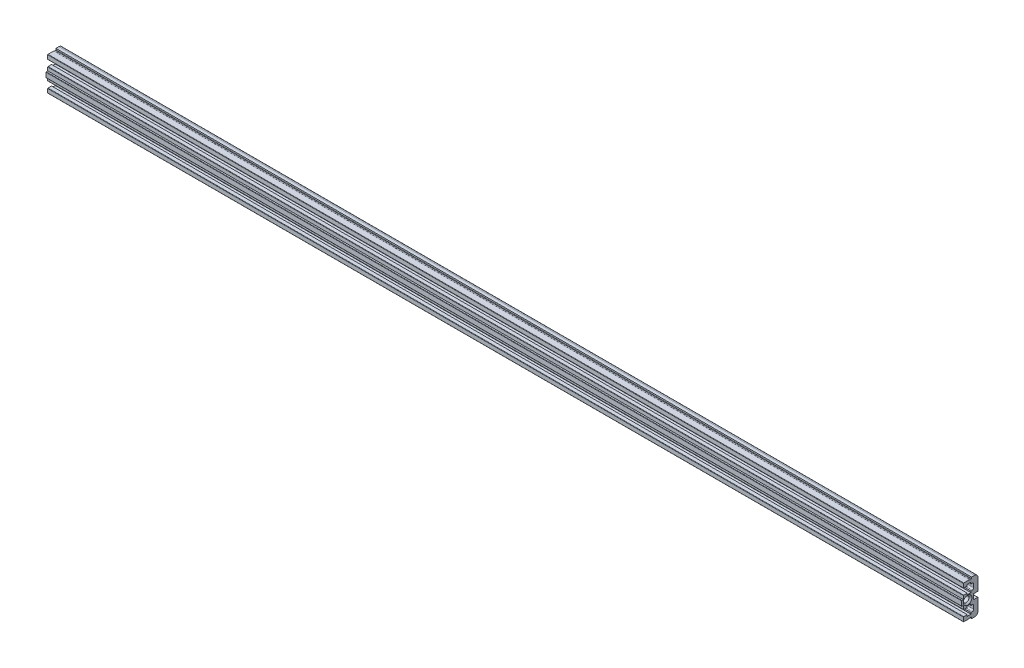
ISO-10303-21;
HEADER;
FILE_DESCRIPTION(('STEP AP214'),'2;1');
FILE_NAME('part.step','',(''),(''),'','','');
FILE_SCHEMA(('AUTOMOTIVE_DESIGN { 1 0 10303 214 1 1 1 1 }'));
ENDSEC;
DATA;
#1=APPLICATION_CONTEXT('core data for automotive mechanical design processes');
#2=APPLICATION_PROTOCOL_DEFINITION('international standard','automotive_design',2000,#1);
#3=PRODUCT_CONTEXT('',#1,'mechanical');
#4=PRODUCT('Part','Part','',(#3));
#5=PRODUCT_RELATED_PRODUCT_CATEGORY('part','',(#4));
#6=PRODUCT_DEFINITION_FORMATION('','',#4);
#7=PRODUCT_DEFINITION_CONTEXT('part definition',#1,'design');
#8=PRODUCT_DEFINITION('design','',#6,#7);
#9=PRODUCT_DEFINITION_SHAPE('','',#8);
#10=(LENGTH_UNIT() NAMED_UNIT(*) SI_UNIT(.MILLI.,.METRE.));
#11=(NAMED_UNIT(*) PLANE_ANGLE_UNIT() SI_UNIT($,.RADIAN.));
#12=(NAMED_UNIT(*) SI_UNIT($,.STERADIAN.) SOLID_ANGLE_UNIT());
#13=UNCERTAINTY_MEASURE_WITH_UNIT(LENGTH_MEASURE(1.E-05),#10,'distance_accuracy_value','');
#14=(GEOMETRIC_REPRESENTATION_CONTEXT(3) GLOBAL_UNCERTAINTY_ASSIGNED_CONTEXT((#13)) GLOBAL_UNIT_ASSIGNED_CONTEXT((#10,
#11,#12)) REPRESENTATION_CONTEXT('',''));
#15=CARTESIAN_POINT('',(0.,0.,0.));
#16=DIRECTION('',(0.,0.,1.));
#17=DIRECTION('',(1.,0.,0.));
#18=AXIS2_PLACEMENT_3D('',#15,#16,#17);
#19=CARTESIAN_POINT('',(215.9,-9.9,14.8));
#20=DIRECTION('',(1.,0.,0.));
#21=DIRECTION('',(0.,0.,-1.));
#22=AXIS2_PLACEMENT_3D('',#19,#20,#21);
#23=CYLINDRICAL_SURFACE('',#22,1.25);
#24=CARTESIAN_POINT('',(-200.659655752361,-9.9,14.8));
#25=DIRECTION('',(-1.,0.,0.));
#26=DIRECTION('',(0.,0.,1.));
#27=AXIS2_PLACEMENT_3D('',#24,#25,#26);
#28=CIRCLE('',#27,1.250000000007);
#29=CARTESIAN_POINT('',(-200.659655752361,-9.9,16.050000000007));
#30=VERTEX_POINT('',#29);
#31=EDGE_CURVE('E717',#30,#30,#28,.T.);
#32=ORIENTED_EDGE('',*,*,#31,.T.);
#33=EDGE_LOOP('',(#32));
#34=FACE_BOUND('',#33,.T.);
#35=CARTESIAN_POINT('',(302.48,-9.9,14.8));
#36=DIRECTION('',(1.,0.,0.));
#37=DIRECTION('',(0.,0.,-1.));
#38=AXIS2_PLACEMENT_3D('',#35,#36,#37);
#39=CIRCLE('',#38,1.25);
#40=CARTESIAN_POINT('',(302.48,-9.9,13.55));
#41=VERTEX_POINT('',#40);
#42=EDGE_CURVE('E325',#41,#41,#39,.F.);
#43=ORIENTED_EDGE('',*,*,#42,.F.);
#44=EDGE_LOOP('',(#43));
#45=FACE_BOUND('',#44,.T.);
#46=ADVANCED_FACE('F50',(#34,#45),#23,.F.);
#47=CARTESIAN_POINT('',(-215.9,-19.4,12.5));
#48=DIRECTION('',(0.,1.,0.));
#49=DIRECTION('',(0.,0.,1.));
#50=AXIS2_PLACEMENT_3D('',#47,#48,#49);
#51=PLANE('',#50);
#52=DIRECTION('',(1.,0.,0.));
#53=VECTOR('',#52,1.);
#54=CARTESIAN_POINT('',(-215.9,-19.4,12.7));
#55=LINE('',#54,#53);
#56=CARTESIAN_POINT('',(-215.9,-19.4,12.7));
#57=VERTEX_POINT('',#56);
#58=CARTESIAN_POINT('',(317.5,-19.4,12.7));
#59=VERTEX_POINT('',#58);
#60=EDGE_CURVE('E710',#57,#59,#55,.T.);
#61=ORIENTED_EDGE('',*,*,#60,.T.);
#62=DIRECTION('',(0.,0.,-1.));
#63=VECTOR('',#62,1.);
#64=CARTESIAN_POINT('',(317.5,-19.4,13.3));
#65=LINE('',#64,#63);
#66=CARTESIAN_POINT('',(317.5,-19.4,13.3));
#67=VERTEX_POINT('',#66);
#68=EDGE_CURVE('E1088',#67,#59,#65,.T.);
#69=ORIENTED_EDGE('',*,*,#68,.F.);
#70=DIRECTION('',(1.,0.,0.));
#71=VECTOR('',#70,1.);
#72=CARTESIAN_POINT('',(-215.9,-19.4,13.3));
#73=LINE('',#72,#71);
#74=CARTESIAN_POINT('',(-215.9,-19.4,13.3));
#75=VERTEX_POINT('',#74);
#76=EDGE_CURVE('E209',#67,#75,#73,.F.);
#77=ORIENTED_EDGE('',*,*,#76,.T.);
#78=DIRECTION('',(0.,0.,1.));
#79=VECTOR('',#78,1.);
#80=CARTESIAN_POINT('',(-215.9,-19.4,12.5));
#81=LINE('',#80,#79);
#82=EDGE_CURVE('E723',#57,#75,#81,.T.);
#83=ORIENTED_EDGE('',*,*,#82,.F.);
#84=EDGE_LOOP('',(#61,#69,#77,#83));
#85=FACE_BOUND('',#84,.T.);
#86=ADVANCED_FACE('F1180',(#85),#51,.F.);
#87=CARTESIAN_POINT('',(-215.9,-0.400000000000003,12.5));
#88=DIRECTION('',(0.,-1.,0.));
#89=DIRECTION('',(0.,0.,-1.));
#90=AXIS2_PLACEMENT_3D('',#87,#88,#89);
#91=PLANE('',#90);
#92=DIRECTION('',(1.,0.,0.));
#93=VECTOR('',#92,1.);
#94=CARTESIAN_POINT('',(-215.9,-0.400000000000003,13.3));
#95=LINE('',#94,#93);
#96=CARTESIAN_POINT('',(-215.9,-0.400000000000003,13.3));
#97=VERTEX_POINT('',#96);
#98=CARTESIAN_POINT('',(317.5,-0.400000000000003,13.3));
#99=VERTEX_POINT('',#98);
#100=EDGE_CURVE('E318',#97,#99,#95,.T.);
#101=ORIENTED_EDGE('',*,*,#100,.T.);
#102=DIRECTION('',(0.,0.,1.));
#103=VECTOR('',#102,1.);
#104=CARTESIAN_POINT('',(317.5,-0.400000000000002,12.7));
#105=LINE('',#104,#103);
#106=CARTESIAN_POINT('',(317.5,-0.400000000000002,12.7));
#107=VERTEX_POINT('',#106);
#108=EDGE_CURVE('E797',#107,#99,#105,.T.);
#109=ORIENTED_EDGE('',*,*,#108,.F.);
#110=DIRECTION('',(1.,0.,0.));
#111=VECTOR('',#110,1.);
#112=CARTESIAN_POINT('',(-215.9,-0.400000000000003,12.7));
#113=LINE('',#112,#111);
#114=CARTESIAN_POINT('',(-215.9,-0.400000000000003,12.7));
#115=VERTEX_POINT('',#114);
#116=EDGE_CURVE('E707',#107,#115,#113,.F.);
#117=ORIENTED_EDGE('',*,*,#116,.T.);
#118=DIRECTION('',(0.,0.,-1.));
#119=VECTOR('',#118,1.);
#120=CARTESIAN_POINT('',(-215.9,-0.400000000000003,12.5));
#121=LINE('',#120,#119);
#122=EDGE_CURVE('E720',#97,#115,#121,.T.);
#123=ORIENTED_EDGE('',*,*,#122,.F.);
#124=EDGE_LOOP('',(#101,#109,#117,#123));
#125=FACE_BOUND('',#124,.T.);
#126=ADVANCED_FACE('F793',(#125),#91,.F.);
#127=CARTESIAN_POINT('',(-215.9,-19.6,13.3));
#128=DIRECTION('',(1.,0.,0.));
#129=DIRECTION('',(0.,0.,-1.));
#130=AXIS2_PLACEMENT_3D('',#127,#128,#129);
#131=CYLINDRICAL_SURFACE('',#130,0.2);
#132=ORIENTED_EDGE('',*,*,#76,.F.);
#133=CARTESIAN_POINT('',(317.5,-19.6,13.3));
#134=DIRECTION('',(-1.,0.,0.));
#135=DIRECTION('',(0.,0.,-1.));
#136=AXIS2_PLACEMENT_3D('',#133,#134,#135);
#137=CIRCLE('',#136,0.199999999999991);
#138=CARTESIAN_POINT('',(317.5,-19.55,13.4936491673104));
#139=VERTEX_POINT('',#138);
#140=EDGE_CURVE('E1085',#139,#67,#137,.T.);
#141=ORIENTED_EDGE('',*,*,#140,.F.);
#142=DIRECTION('',(1.,0.,0.));
#143=VECTOR('',#142,1.);
#144=CARTESIAN_POINT('',(-215.9,-19.55,13.4936491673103));
#145=LINE('',#144,#143);
#146=CARTESIAN_POINT('',(-215.9,-19.55,13.4936491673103));
#147=VERTEX_POINT('',#146);
#148=EDGE_CURVE('E594',#147,#139,#145,.T.);
#149=ORIENTED_EDGE('',*,*,#148,.F.);
#150=CARTESIAN_POINT('',(-215.9,-19.6,13.3));
#151=DIRECTION('',(1.,0.,0.));
#152=DIRECTION('',(0.,0.,-1.));
#153=AXIS2_PLACEMENT_3D('',#150,#151,#152);
#154=CIRCLE('',#153,0.2);
#155=EDGE_CURVE('E711',#75,#147,#154,.T.);
#156=ORIENTED_EDGE('',*,*,#155,.F.);
#157=EDGE_LOOP('',(#132,#141,#149,#156));
#158=FACE_BOUND('',#157,.T.);
#159=ADVANCED_FACE('F1186',(#158),#131,.F.);
#160=CARTESIAN_POINT('',(-215.9,-19.6,12.7));
#161=DIRECTION('',(1.,0.,0.));
#162=DIRECTION('',(0.,0.,-1.));
#163=AXIS2_PLACEMENT_3D('',#160,#161,#162);
#164=CYLINDRICAL_SURFACE('',#163,0.2);
#165=DIRECTION('',(-1.,0.,0.));
#166=VECTOR('',#165,1.);
#167=CARTESIAN_POINT('',(-215.9,-19.6,12.5));
#168=LINE('',#167,#166);
#169=CARTESIAN_POINT('',(-215.9,-19.6,12.5));
#170=VERTEX_POINT('',#169);
#171=CARTESIAN_POINT('',(317.5,-19.6,12.5));
#172=VERTEX_POINT('',#171);
#173=EDGE_CURVE('E593',#170,#172,#168,.F.);
#174=ORIENTED_EDGE('',*,*,#173,.T.);
#175=CARTESIAN_POINT('',(317.5,-19.6,12.7));
#176=DIRECTION('',(-1.,0.,0.));
#177=DIRECTION('',(0.,0.,-1.));
#178=AXIS2_PLACEMENT_3D('',#175,#176,#177);
#179=CIRCLE('',#178,0.199999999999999);
#180=EDGE_CURVE('E1091',#59,#172,#179,.T.);
#181=ORIENTED_EDGE('',*,*,#180,.F.);
#182=ORIENTED_EDGE('',*,*,#60,.F.);
#183=CARTESIAN_POINT('',(-215.9,-19.6,12.7));
#184=DIRECTION('',(1.,0.,0.));
#185=DIRECTION('',(0.,0.,-1.));
#186=AXIS2_PLACEMENT_3D('',#183,#184,#185);
#187=CIRCLE('',#186,0.2);
#188=EDGE_CURVE('E708',#170,#57,#187,.T.);
#189=ORIENTED_EDGE('',*,*,#188,.F.);
#190=EDGE_LOOP('',(#174,#181,#182,#189));
#191=FACE_BOUND('',#190,.T.);
#192=ADVANCED_FACE('F1177',(#191),#164,.F.);
#193=CARTESIAN_POINT('',(-215.9,-0.200000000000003,12.7));
#194=DIRECTION('',(1.,0.,0.));
#195=DIRECTION('',(0.,0.,-1.));
#196=AXIS2_PLACEMENT_3D('',#193,#194,#195);
#197=CYLINDRICAL_SURFACE('',#196,0.2);
#198=ORIENTED_EDGE('',*,*,#116,.F.);
#199=CARTESIAN_POINT('',(317.5,-0.200000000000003,12.7));
#200=DIRECTION('',(-1.,0.,0.));
#201=DIRECTION('',(0.,0.,-1.));
#202=AXIS2_PLACEMENT_3D('',#199,#200,#201);
#203=CIRCLE('',#202,0.199999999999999);
#204=CARTESIAN_POINT('',(317.5,-0.200000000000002,12.5));
#205=VERTEX_POINT('',#204);
#206=EDGE_CURVE('E803',#205,#107,#203,.T.);
#207=ORIENTED_EDGE('',*,*,#206,.F.);
#208=DIRECTION('',(1.,0.,0.));
#209=VECTOR('',#208,1.);
#210=CARTESIAN_POINT('',(-215.9,-0.200000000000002,12.5));
#211=LINE('',#210,#209);
#212=CARTESIAN_POINT('',(-215.9,-0.200000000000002,12.5));
#213=VERTEX_POINT('',#212);
#214=EDGE_CURVE('E587',#205,#213,#211,.F.);
#215=ORIENTED_EDGE('',*,*,#214,.T.);
#216=CARTESIAN_POINT('',(-215.9,-0.200000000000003,12.7));
#217=DIRECTION('',(1.,0.,0.));
#218=DIRECTION('',(0.,0.,-1.));
#219=AXIS2_PLACEMENT_3D('',#216,#217,#218);
#220=CIRCLE('',#219,0.2);
#221=EDGE_CURVE('E704',#115,#213,#220,.T.);
#222=ORIENTED_EDGE('',*,*,#221,.F.);
#223=EDGE_LOOP('',(#198,#207,#215,#222));
#224=FACE_BOUND('',#223,.T.);
#225=ADVANCED_FACE('F801',(#224),#197,.F.);
#226=CARTESIAN_POINT('',(-215.9,-0.200000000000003,13.3));
#227=DIRECTION('',(1.,0.,0.));
#228=DIRECTION('',(0.,0.,-1.));
#229=AXIS2_PLACEMENT_3D('',#226,#227,#228);
#230=CYLINDRICAL_SURFACE('',#229,0.2);
#231=DIRECTION('',(1.,0.,0.));
#232=VECTOR('',#231,1.);
#233=CARTESIAN_POINT('',(-215.9,-0.249999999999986,13.4936491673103));
#234=LINE('',#233,#232);
#235=CARTESIAN_POINT('',(317.5,-0.249999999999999,13.4936491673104));
#236=VERTEX_POINT('',#235);
#237=CARTESIAN_POINT('',(-215.9,-0.249999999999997,13.4936491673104));
#238=VERTEX_POINT('',#237);
#239=EDGE_CURVE('E657',#236,#238,#234,.F.);
#240=ORIENTED_EDGE('',*,*,#239,.F.);
#241=CARTESIAN_POINT('',(317.5,-0.200000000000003,13.3));
#242=DIRECTION('',(-1.,0.,0.));
#243=DIRECTION('',(0.,0.,-1.));
#244=AXIS2_PLACEMENT_3D('',#241,#242,#243);
#245=CIRCLE('',#244,0.2);
#246=EDGE_CURVE('E813',#99,#236,#245,.T.);
#247=ORIENTED_EDGE('',*,*,#246,.F.);
#248=ORIENTED_EDGE('',*,*,#100,.F.);
#249=CARTESIAN_POINT('',(-215.9,-0.200000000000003,13.3));
#250=DIRECTION('',(1.,0.,0.));
#251=DIRECTION('',(0.,0.,-1.));
#252=AXIS2_PLACEMENT_3D('',#249,#250,#251);
#253=CIRCLE('',#252,0.2);
#254=EDGE_CURVE('E300',#238,#97,#253,.T.);
#255=ORIENTED_EDGE('',*,*,#254,.F.);
#256=EDGE_LOOP('',(#240,#247,#248,#255));
#257=FACE_BOUND('',#256,.T.);
#258=ADVANCED_FACE('F1203',(#257),#230,.F.);
#259=CARTESIAN_POINT('',(-215.9,-2.7,12.85));
#260=DIRECTION('',(0.,1.,0.));
#261=DIRECTION('',(0.,0.,1.));
#262=AXIS2_PLACEMENT_3D('',#259,#260,#261);
#263=PLANE('',#262);
#264=DIRECTION('',(1.,0.,0.));
#265=VECTOR('',#264,1.);
#266=CARTESIAN_POINT('',(-215.9,-2.7,12.05));
#267=LINE('',#266,#265);
#268=CARTESIAN_POINT('',(-215.9,-2.7,12.05));
#269=VERTEX_POINT('',#268);
#270=CARTESIAN_POINT('',(317.5,-2.7,12.05));
#271=VERTEX_POINT('',#270);
#272=EDGE_CURVE('E308',#269,#271,#267,.T.);
#273=ORIENTED_EDGE('',*,*,#272,.T.);
#274=DIRECTION('',(0.,0.,-1.));
#275=VECTOR('',#274,1.);
#276=CARTESIAN_POINT('',(317.5,-2.7,12.85));
#277=LINE('',#276,#275);
#278=CARTESIAN_POINT('',(317.5,-2.7,12.85));
#279=VERTEX_POINT('',#278);
#280=EDGE_CURVE('E282',#279,#271,#277,.T.);
#281=ORIENTED_EDGE('',*,*,#280,.F.);
#282=DIRECTION('',(1.,0.,0.));
#283=VECTOR('',#282,1.);
#284=CARTESIAN_POINT('',(-215.9,-2.7,12.85));
#285=LINE('',#284,#283);
#286=CARTESIAN_POINT('',(-215.9,-2.7,12.85));
#287=VERTEX_POINT('',#286);
#288=EDGE_CURVE('E274',#279,#287,#285,.F.);
#289=ORIENTED_EDGE('',*,*,#288,.T.);
#290=DIRECTION('',(0.,0.,1.));
#291=VECTOR('',#290,1.);
#292=CARTESIAN_POINT('',(-215.9,-2.7,12.85));
#293=LINE('',#292,#291);
#294=EDGE_CURVE('E278',#269,#287,#293,.T.);
#295=ORIENTED_EDGE('',*,*,#294,.F.);
#296=EDGE_LOOP('',(#273,#281,#289,#295));
#297=FACE_BOUND('',#296,.T.);
#298=ADVANCED_FACE('F277',(#297),#263,.F.);
#299=CARTESIAN_POINT('',(-215.9,-6.25,12.85));
#300=DIRECTION('',(0.,-1.,0.));
#301=DIRECTION('',(0.,0.,-1.));
#302=AXIS2_PLACEMENT_3D('',#299,#300,#301);
#303=PLANE('',#302);
#304=DIRECTION('',(1.,0.,0.));
#305=VECTOR('',#304,1.);
#306=CARTESIAN_POINT('',(-215.9,-6.25,12.85));
#307=LINE('',#306,#305);
#308=CARTESIAN_POINT('',(-215.9,-6.25,12.85));
#309=VERTEX_POINT('',#308);
#310=CARTESIAN_POINT('',(317.5,-6.25,12.85));
#311=VERTEX_POINT('',#310);
#312=EDGE_CURVE('E578',#309,#311,#307,.T.);
#313=ORIENTED_EDGE('',*,*,#312,.T.);
#314=DIRECTION('',(0.,0.,1.));
#315=VECTOR('',#314,1.);
#316=CARTESIAN_POINT('',(317.5,-6.25,12.05));
#317=LINE('',#316,#315);
#318=CARTESIAN_POINT('',(317.5,-6.25,12.05));
#319=VERTEX_POINT('',#318);
#320=EDGE_CURVE('E856',#319,#311,#317,.T.);
#321=ORIENTED_EDGE('',*,*,#320,.F.);
#322=DIRECTION('',(1.,0.,0.));
#323=VECTOR('',#322,1.);
#324=CARTESIAN_POINT('',(-215.9,-6.25,12.05));
#325=LINE('',#324,#323);
#326=CARTESIAN_POINT('',(-215.9,-6.25,12.05));
#327=VERTEX_POINT('',#326);
#328=EDGE_CURVE('E640',#319,#327,#325,.F.);
#329=ORIENTED_EDGE('',*,*,#328,.T.);
#330=DIRECTION('',(0.,0.,-1.));
#331=VECTOR('',#330,1.);
#332=CARTESIAN_POINT('',(-215.9,-6.25,12.85));
#333=LINE('',#332,#331);
#334=EDGE_CURVE('E299',#309,#327,#333,.T.);
#335=ORIENTED_EDGE('',*,*,#334,.F.);
#336=EDGE_LOOP('',(#313,#321,#329,#335));
#337=FACE_BOUND('',#336,.T.);
#338=ADVANCED_FACE('F1209',(#337),#303,.F.);
#339=CARTESIAN_POINT('',(-215.9,-13.55,12.85));
#340=DIRECTION('',(0.,1.,0.));
#341=DIRECTION('',(0.,0.,1.));
#342=AXIS2_PLACEMENT_3D('',#339,#340,#341);
#343=PLANE('',#342);
#344=DIRECTION('',(1.,0.,0.));
#345=VECTOR('',#344,1.);
#346=CARTESIAN_POINT('',(-215.9,-13.55,12.05));
#347=LINE('',#346,#345);
#348=CARTESIAN_POINT('',(-215.9,-13.55,12.05));
#349=VERTEX_POINT('',#348);
#350=CARTESIAN_POINT('',(317.5,-13.55,12.05));
#351=VERTEX_POINT('',#350);
#352=EDGE_CURVE('E559',#349,#351,#347,.T.);
#353=ORIENTED_EDGE('',*,*,#352,.T.);
#354=DIRECTION('',(0.,0.,-1.));
#355=VECTOR('',#354,1.);
#356=CARTESIAN_POINT('',(317.5,-13.55,12.85));
#357=LINE('',#356,#355);
#358=CARTESIAN_POINT('',(317.5,-13.55,12.85));
#359=VERTEX_POINT('',#358);
#360=EDGE_CURVE('E1043',#359,#351,#357,.T.);
#361=ORIENTED_EDGE('',*,*,#360,.F.);
#362=DIRECTION('',(1.,0.,0.));
#363=VECTOR('',#362,1.);
#364=CARTESIAN_POINT('',(-215.9,-13.55,12.85));
#365=LINE('',#364,#363);
#366=CARTESIAN_POINT('',(-215.9,-13.55,12.85));
#367=VERTEX_POINT('',#366);
#368=EDGE_CURVE('E322',#359,#367,#365,.F.);
#369=ORIENTED_EDGE('',*,*,#368,.T.);
#370=DIRECTION('',(0.,0.,1.));
#371=VECTOR('',#370,1.);
#372=CARTESIAN_POINT('',(-215.9,-13.55,12.85));
#373=LINE('',#372,#371);
#374=EDGE_CURVE('E613',#349,#367,#373,.T.);
#375=ORIENTED_EDGE('',*,*,#374,.F.);
#376=EDGE_LOOP('',(#353,#361,#369,#375));
#377=FACE_BOUND('',#376,.T.);
#378=ADVANCED_FACE('F1212',(#377),#343,.F.);
#379=CARTESIAN_POINT('',(-215.9,-17.1,12.85));
#380=DIRECTION('',(0.,-1.,0.));
#381=DIRECTION('',(0.,0.,-1.));
#382=AXIS2_PLACEMENT_3D('',#379,#380,#381);
#383=PLANE('',#382);
#384=DIRECTION('',(1.,0.,0.));
#385=VECTOR('',#384,1.);
#386=CARTESIAN_POINT('',(-215.9,-17.1,12.85));
#387=LINE('',#386,#385);
#388=CARTESIAN_POINT('',(-215.9,-17.1,12.85));
#389=VERTEX_POINT('',#388);
#390=CARTESIAN_POINT('',(317.5,-17.1,12.85));
#391=VERTEX_POINT('',#390);
#392=EDGE_CURVE('E553',#389,#391,#387,.T.);
#393=ORIENTED_EDGE('',*,*,#392,.T.);
#394=DIRECTION('',(0.,0.,1.));
#395=VECTOR('',#394,1.);
#396=CARTESIAN_POINT('',(317.5,-17.1,12.05));
#397=LINE('',#396,#395);
#398=CARTESIAN_POINT('',(317.5,-17.1,12.05));
#399=VERTEX_POINT('',#398);
#400=EDGE_CURVE('E1055',#399,#391,#397,.T.);
#401=ORIENTED_EDGE('',*,*,#400,.F.);
#402=DIRECTION('',(1.,0.,0.));
#403=VECTOR('',#402,1.);
#404=CARTESIAN_POINT('',(-215.9,-17.1,12.05));
#405=LINE('',#404,#403);
#406=CARTESIAN_POINT('',(-215.9,-17.1,12.05));
#407=VERTEX_POINT('',#406);
#408=EDGE_CURVE('E605',#399,#407,#405,.F.);
#409=ORIENTED_EDGE('',*,*,#408,.T.);
#410=DIRECTION('',(0.,0.,-1.));
#411=VECTOR('',#410,1.);
#412=CARTESIAN_POINT('',(-215.9,-17.1,12.85));
#413=LINE('',#412,#411);
#414=EDGE_CURVE('E609',#389,#407,#413,.T.);
#415=ORIENTED_EDGE('',*,*,#414,.F.);
#416=EDGE_LOOP('',(#393,#401,#409,#415));
#417=FACE_BOUND('',#416,.T.);
#418=ADVANCED_FACE('F1216',(#417),#383,.F.);
#419=CARTESIAN_POINT('',(-215.9,-19.5,13.6872983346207));
#420=DIRECTION('',(1.,0.,0.));
#421=DIRECTION('',(0.,0.,-1.));
#422=AXIS2_PLACEMENT_3D('',#419,#420,#421);
#423=CYLINDRICAL_SURFACE('',#422,0.2);
#424=ORIENTED_EDGE('',*,*,#148,.T.);
#425=CARTESIAN_POINT('',(317.5,-19.5,13.6872983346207));
#426=DIRECTION('',(1.,0.,0.));
#427=DIRECTION('',(0.,0.,-1.));
#428=AXIS2_PLACEMENT_3D('',#425,#426,#427);
#429=CIRCLE('',#428,0.199999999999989);
#430=CARTESIAN_POINT('',(317.5,-19.7,13.6872983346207));
#431=VERTEX_POINT('',#430);
#432=EDGE_CURVE('E1082',#431,#139,#429,.T.);
#433=ORIENTED_EDGE('',*,*,#432,.F.);
#434=DIRECTION('',(1.,0.,0.));
#435=VECTOR('',#434,1.);
#436=CARTESIAN_POINT('',(-215.9,-19.7,13.6872983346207));
#437=LINE('',#436,#435);
#438=CARTESIAN_POINT('',(-215.9,-19.7,13.6872983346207));
#439=VERTEX_POINT('',#438);
#440=EDGE_CURVE('E537',#431,#439,#437,.F.);
#441=ORIENTED_EDGE('',*,*,#440,.T.);
#442=CARTESIAN_POINT('',(-215.9,-19.5,13.6872983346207));
#443=DIRECTION('',(1.,0.,0.));
#444=DIRECTION('',(0.,0.,-1.));
#445=AXIS2_PLACEMENT_3D('',#442,#443,#444);
#446=CIRCLE('',#445,0.2);
#447=EDGE_CURVE('E666',#439,#147,#446,.T.);
#448=ORIENTED_EDGE('',*,*,#447,.T.);
#449=EDGE_LOOP('',(#424,#433,#441,#448));
#450=FACE_BOUND('',#449,.T.);
#451=ADVANCED_FACE('F1220',(#450),#423,.T.);
#452=CARTESIAN_POINT('',(-215.9,-19.7,12.5));
#453=DIRECTION('',(0.,0.,-1.));
#454=DIRECTION('',(-1.,0.,0.));
#455=AXIS2_PLACEMENT_3D('',#452,#453,#454);
#456=PLANE('',#455);
#457=DIRECTION('',(1.,0.,0.));
#458=VECTOR('',#457,1.);
#459=CARTESIAN_POINT('',(215.9,-20.4,12.5));
#460=LINE('',#459,#458);
#461=CARTESIAN_POINT('',(-215.9,-20.4,12.5));
#462=VERTEX_POINT('',#461);
#463=CARTESIAN_POINT('',(317.5,-20.4,12.5));
#464=VERTEX_POINT('',#463);
#465=EDGE_CURVE('E534',#462,#464,#460,.T.);
#466=ORIENTED_EDGE('',*,*,#465,.T.);
#467=DIRECTION('',(0.,-1.,0.));
#468=VECTOR('',#467,1.);
#469=CARTESIAN_POINT('',(317.5,-19.6,12.5));
#470=LINE('',#469,#468);
#471=EDGE_CURVE('E1094',#172,#464,#470,.T.);
#472=ORIENTED_EDGE('',*,*,#471,.F.);
#473=ORIENTED_EDGE('',*,*,#173,.F.);
#474=DIRECTION('',(0.,1.,0.));
#475=VECTOR('',#474,1.);
#476=CARTESIAN_POINT('',(-215.9,-19.7,12.5));
#477=LINE('',#476,#475);
#478=EDGE_CURVE('E590',#462,#170,#477,.T.);
#479=ORIENTED_EDGE('',*,*,#478,.F.);
#480=EDGE_LOOP('',(#466,#472,#473,#479));
#481=FACE_BOUND('',#480,.T.);
#482=ADVANCED_FACE('F1174',(#481),#456,.F.);
#483=CARTESIAN_POINT('',(215.9,-11.6,8.95));
#484=DIRECTION('',(1.,0.,0.));
#485=DIRECTION('',(0.,0.,-1.));
#486=AXIS2_PLACEMENT_3D('',#483,#484,#485);
#487=CYLINDRICAL_SURFACE('',#486,0.2);
#488=DIRECTION('',(1.,0.,0.));
#489=VECTOR('',#488,1.);
#490=CARTESIAN_POINT('',(215.9,-11.4,8.95));
#491=LINE('',#490,#489);
#492=CARTESIAN_POINT('',(-215.9,-11.4,8.95));
#493=VERTEX_POINT('',#492);
#494=CARTESIAN_POINT('',(317.5,-11.4,8.95));
#495=VERTEX_POINT('',#494);
#496=EDGE_CURVE('E522',#493,#495,#491,.T.);
#497=ORIENTED_EDGE('',*,*,#496,.T.);
#498=CARTESIAN_POINT('',(317.5,-11.6,8.95));
#499=DIRECTION('',(1.,0.,0.));
#500=DIRECTION('',(0.,0.,-1.));
#501=AXIS2_PLACEMENT_3D('',#498,#499,#500);
#502=CIRCLE('',#501,0.2);
#503=CARTESIAN_POINT('',(317.5,-11.6,8.75));
#504=VERTEX_POINT('',#503);
#505=EDGE_CURVE('E1106',#504,#495,#502,.T.);
#506=ORIENTED_EDGE('',*,*,#505,.F.);
#507=DIRECTION('',(1.,0.,0.));
#508=VECTOR('',#507,1.);
#509=CARTESIAN_POINT('',(215.9,-11.6,8.75));
#510=LINE('',#509,#508);
#511=CARTESIAN_POINT('',(-215.9,-11.6,8.75));
#512=VERTEX_POINT('',#511);
#513=EDGE_CURVE('E527',#504,#512,#510,.F.);
#514=ORIENTED_EDGE('',*,*,#513,.T.);
#515=CARTESIAN_POINT('',(-215.9,-11.6,8.95));
#516=DIRECTION('',(1.,0.,0.));
#517=DIRECTION('',(0.,0.,-1.));
#518=AXIS2_PLACEMENT_3D('',#515,#516,#517);
#519=CIRCLE('',#518,0.2);
#520=EDGE_CURVE('E661',#512,#493,#519,.T.);
#521=ORIENTED_EDGE('',*,*,#520,.T.);
#522=EDGE_LOOP('',(#497,#506,#514,#521));
#523=FACE_BOUND('',#522,.T.);
#524=ADVANCED_FACE('F1157',(#523),#487,.T.);
#525=CARTESIAN_POINT('',(-215.9,-0.100000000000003,12.5));
#526=DIRECTION('',(0.,0.,-1.));
#527=DIRECTION('',(0.,1.,0.));
#528=AXIS2_PLACEMENT_3D('',#525,#526,#527);
#529=PLANE('',#528);
#530=ORIENTED_EDGE('',*,*,#214,.F.);
#531=DIRECTION('',(0.,-1.,0.));
#532=VECTOR('',#531,1.);
#533=CARTESIAN_POINT('',(317.5,0.599999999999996,12.5));
#534=LINE('',#533,#532);
#535=CARTESIAN_POINT('',(317.5,0.599999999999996,12.5));
#536=VERTEX_POINT('',#535);
#537=EDGE_CURVE('E811',#536,#205,#534,.T.);
#538=ORIENTED_EDGE('',*,*,#537,.F.);
#539=DIRECTION('',(1.,0.,0.));
#540=VECTOR('',#539,1.);
#541=CARTESIAN_POINT('',(215.9,0.599999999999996,12.5));
#542=LINE('',#541,#540);
#543=CARTESIAN_POINT('',(-215.9,0.599999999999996,12.5));
#544=VERTEX_POINT('',#543);
#545=EDGE_CURVE('E502',#536,#544,#542,.F.);
#546=ORIENTED_EDGE('',*,*,#545,.T.);
#547=DIRECTION('',(0.,1.,0.));
#548=VECTOR('',#547,1.);
#549=CARTESIAN_POINT('',(-215.9,-0.100000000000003,12.5));
#550=LINE('',#549,#548);
#551=EDGE_CURVE('E583',#213,#544,#550,.T.);
#552=ORIENTED_EDGE('',*,*,#551,.F.);
#553=EDGE_LOOP('',(#530,#538,#546,#552));
#554=FACE_BOUND('',#553,.T.);
#555=ADVANCED_FACE('F1129',(#554),#529,.F.);
#556=CARTESIAN_POINT('',(-215.9,-0.300000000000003,13.6872983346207));
#557=DIRECTION('',(1.,0.,0.));
#558=DIRECTION('',(0.,0.,-1.));
#559=AXIS2_PLACEMENT_3D('',#556,#557,#558);
#560=CYLINDRICAL_SURFACE('',#559,0.2);
#561=DIRECTION('',(1.,0.,0.));
#562=VECTOR('',#561,1.);
#563=CARTESIAN_POINT('',(-215.9,-0.100000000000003,13.6872983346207));
#564=LINE('',#563,#562);
#565=CARTESIAN_POINT('',(-215.9,-0.100000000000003,13.6872983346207));
#566=VERTEX_POINT('',#565);
#567=CARTESIAN_POINT('',(317.5,-0.100000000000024,13.6872983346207));
#568=VERTEX_POINT('',#567);
#569=EDGE_CURVE('E504',#566,#568,#564,.T.);
#570=ORIENTED_EDGE('',*,*,#569,.T.);
#571=CARTESIAN_POINT('',(317.5,-0.300000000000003,13.6872983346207));
#572=DIRECTION('',(1.,0.,0.));
#573=DIRECTION('',(0.,0.,-1.));
#574=AXIS2_PLACEMENT_3D('',#571,#572,#573);
#575=CIRCLE('',#574,0.199999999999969);
#576=EDGE_CURVE('E820',#236,#568,#575,.T.);
#577=ORIENTED_EDGE('',*,*,#576,.F.);
#578=ORIENTED_EDGE('',*,*,#239,.T.);
#579=CARTESIAN_POINT('',(-215.9,-0.300000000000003,13.6872983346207));
#580=DIRECTION('',(1.,0.,0.));
#581=DIRECTION('',(0.,0.,-1.));
#582=AXIS2_PLACEMENT_3D('',#579,#580,#581);
#583=CIRCLE('',#582,0.2);
#584=EDGE_CURVE('E586',#238,#566,#583,.T.);
#585=ORIENTED_EDGE('',*,*,#584,.T.);
#586=EDGE_LOOP('',(#570,#577,#578,#585));
#587=FACE_BOUND('',#586,.T.);
#588=ADVANCED_FACE('F1235',(#587),#560,.T.);
#589=CARTESIAN_POINT('',(-215.9,-0.300000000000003,17.05));
#590=DIRECTION('',(-1.,0.,0.));
#591=DIRECTION('',(0.,0.,1.));
#592=AXIS2_PLACEMENT_3D('',#589,#590,#591);
#593=CYLINDRICAL_SURFACE('',#592,0.199999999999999);
#594=DIRECTION('',(1.,0.,0.));
#595=VECTOR('',#594,1.);
#596=CARTESIAN_POINT('',(215.9,-0.300000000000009,17.25));
#597=LINE('',#596,#595);
#598=CARTESIAN_POINT('',(-215.9,-0.300000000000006,17.25));
#599=VERTEX_POINT('',#598);
#600=CARTESIAN_POINT('',(317.5,-0.300000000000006,17.25));
#601=VERTEX_POINT('',#600);
#602=EDGE_CURVE('E499',#599,#601,#597,.T.);
#603=ORIENTED_EDGE('',*,*,#602,.T.);
#604=CARTESIAN_POINT('',(317.5,-0.300000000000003,17.05));
#605=DIRECTION('',(1.,0.,0.));
#606=DIRECTION('',(0.,0.,-1.));
#607=AXIS2_PLACEMENT_3D('',#604,#605,#606);
#608=CIRCLE('',#607,0.199999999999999);
#609=CARTESIAN_POINT('',(317.5,-0.100000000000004,17.05));
#610=VERTEX_POINT('',#609);
#611=EDGE_CURVE('E826',#610,#601,#608,.T.);
#612=ORIENTED_EDGE('',*,*,#611,.F.);
#613=DIRECTION('',(1.,0.,0.));
#614=VECTOR('',#613,1.);
#615=CARTESIAN_POINT('',(-215.9,-0.100000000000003,17.05));
#616=LINE('',#615,#614);
#617=CARTESIAN_POINT('',(-215.9,-0.100000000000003,17.05));
#618=VERTEX_POINT('',#617);
#619=EDGE_CURVE('E509',#610,#618,#616,.F.);
#620=ORIENTED_EDGE('',*,*,#619,.T.);
#621=CARTESIAN_POINT('',(-215.9,-0.300000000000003,17.05));
#622=DIRECTION('',(-1.,0.,0.));
#623=DIRECTION('',(0.,0.,1.));
#624=AXIS2_PLACEMENT_3D('',#621,#622,#623);
#625=CIRCLE('',#624,0.199999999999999);
#626=EDGE_CURVE('E659',#618,#599,#625,.F.);
#627=ORIENTED_EDGE('',*,*,#626,.T.);
#628=EDGE_LOOP('',(#603,#612,#620,#627));
#629=FACE_BOUND('',#628,.T.);
#630=ADVANCED_FACE('F1238',(#629),#593,.T.);
#631=CARTESIAN_POINT('',(215.9,-2.5,17.05));
#632=DIRECTION('',(-1.,0.,0.));
#633=DIRECTION('',(0.,0.,1.));
#634=AXIS2_PLACEMENT_3D('',#631,#632,#633);
#635=CYLINDRICAL_SURFACE('',#634,0.199999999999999);
#636=DIRECTION('',(1.,0.,0.));
#637=VECTOR('',#636,1.);
#638=CARTESIAN_POINT('',(-215.9,-2.7,17.05));
#639=LINE('',#638,#637);
#640=CARTESIAN_POINT('',(-215.9,-2.7,17.05));
#641=VERTEX_POINT('',#640);
#642=CARTESIAN_POINT('',(317.5,-2.7,17.05));
#643=VERTEX_POINT('',#642);
#644=EDGE_CURVE('E493',#641,#643,#639,.T.);
#645=ORIENTED_EDGE('',*,*,#644,.T.);
#646=CARTESIAN_POINT('',(317.5,-2.5,17.05));
#647=DIRECTION('',(1.,0.,0.));
#648=DIRECTION('',(0.,0.,-1.));
#649=AXIS2_PLACEMENT_3D('',#646,#647,#648);
#650=CIRCLE('',#649,0.200000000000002);
#651=CARTESIAN_POINT('',(317.5,-2.5,17.25));
#652=VERTEX_POINT('',#651);
#653=EDGE_CURVE('E832',#652,#643,#650,.T.);
#654=ORIENTED_EDGE('',*,*,#653,.F.);
#655=DIRECTION('',(1.,0.,0.));
#656=VECTOR('',#655,1.);
#657=CARTESIAN_POINT('',(215.9,-2.50000000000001,17.25));
#658=LINE('',#657,#656);
#659=CARTESIAN_POINT('',(-215.9,-2.5,17.25));
#660=VERTEX_POINT('',#659);
#661=EDGE_CURVE('E501',#652,#660,#658,.F.);
#662=ORIENTED_EDGE('',*,*,#661,.T.);
#663=CARTESIAN_POINT('',(-215.9,-2.5,17.05));
#664=DIRECTION('',(-1.,0.,0.));
#665=DIRECTION('',(0.,0.,1.));
#666=AXIS2_PLACEMENT_3D('',#663,#664,#665);
#667=CIRCLE('',#666,0.199999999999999);
#668=EDGE_CURVE('E288',#660,#641,#667,.F.);
#669=ORIENTED_EDGE('',*,*,#668,.T.);
#670=EDGE_LOOP('',(#645,#654,#662,#669));
#671=FACE_BOUND('',#670,.T.);
#672=ADVANCED_FACE('F1242',(#671),#635,.T.);
#673=CARTESIAN_POINT('',(-215.9,-1.85,12.85));
#674=DIRECTION('',(0.,0.,-1.));
#675=DIRECTION('',(0.,1.,0.));
#676=AXIS2_PLACEMENT_3D('',#673,#674,#675);
#677=PLANE('',#676);
#678=ORIENTED_EDGE('',*,*,#288,.F.);
#679=DIRECTION('',(0.,-1.,0.));
#680=VECTOR('',#679,1.);
#681=CARTESIAN_POINT('',(317.5,-1.85,12.85));
#682=LINE('',#681,#680);
#683=CARTESIAN_POINT('',(317.5,-1.85,12.85));
#684=VERTEX_POINT('',#683);
#685=EDGE_CURVE('E844',#684,#279,#682,.T.);
#686=ORIENTED_EDGE('',*,*,#685,.F.);
#687=DIRECTION('',(1.,0.,0.));
#688=VECTOR('',#687,1.);
#689=CARTESIAN_POINT('',(-215.9,-1.85,12.85));
#690=LINE('',#689,#688);
#691=CARTESIAN_POINT('',(-215.9,-1.85,12.85));
#692=VERTEX_POINT('',#691);
#693=EDGE_CURVE('E304',#684,#692,#690,.F.);
#694=ORIENTED_EDGE('',*,*,#693,.T.);
#695=DIRECTION('',(0.,1.,0.));
#696=VECTOR('',#695,1.);
#697=CARTESIAN_POINT('',(-215.9,-1.85,12.85));
#698=LINE('',#697,#696);
#699=EDGE_CURVE('E287',#287,#692,#698,.T.);
#700=ORIENTED_EDGE('',*,*,#699,.F.);
#701=EDGE_LOOP('',(#678,#686,#694,#700));
#702=FACE_BOUND('',#701,.T.);
#703=ADVANCED_FACE('F302',(#702),#677,.F.);
#704=CARTESIAN_POINT('',(-215.9,-1.85,15.05));
#705=DIRECTION('',(0.,0.,1.));
#706=DIRECTION('',(0.,-1.,0.));
#707=AXIS2_PLACEMENT_3D('',#704,#705,#706);
#708=PLANE('',#707);
#709=DIRECTION('',(1.,0.,0.));
#710=VECTOR('',#709,1.);
#711=CARTESIAN_POINT('',(-215.9,-1.85,15.05));
#712=LINE('',#711,#710);
#713=CARTESIAN_POINT('',(-215.9,-1.85,15.05));
#714=VERTEX_POINT('',#713);
#715=CARTESIAN_POINT('',(317.5,-1.85,15.05));
#716=VERTEX_POINT('',#715);
#717=EDGE_CURVE('E490',#714,#716,#712,.T.);
#718=ORIENTED_EDGE('',*,*,#717,.T.);
#719=DIRECTION('',(0.,1.,0.));
#720=VECTOR('',#719,1.);
#721=CARTESIAN_POINT('',(317.5,-2.7,15.05));
#722=LINE('',#721,#720);
#723=CARTESIAN_POINT('',(317.5,-2.7,15.05));
#724=VERTEX_POINT('',#723);
#725=EDGE_CURVE('E838',#724,#716,#722,.T.);
#726=ORIENTED_EDGE('',*,*,#725,.F.);
#727=DIRECTION('',(1.,0.,0.));
#728=VECTOR('',#727,1.);
#729=CARTESIAN_POINT('',(-215.9,-2.7,15.05));
#730=LINE('',#729,#728);
#731=CARTESIAN_POINT('',(-215.9,-2.7,15.05));
#732=VERTEX_POINT('',#731);
#733=EDGE_CURVE('E496',#724,#732,#730,.F.);
#734=ORIENTED_EDGE('',*,*,#733,.T.);
#735=DIRECTION('',(0.,-1.,0.));
#736=VECTOR('',#735,1.);
#737=CARTESIAN_POINT('',(-215.9,-1.85,15.05));
#738=LINE('',#737,#736);
#739=EDGE_CURVE('E305',#714,#732,#738,.T.);
#740=ORIENTED_EDGE('',*,*,#739,.F.);
#741=EDGE_LOOP('',(#718,#726,#734,#740));
#742=FACE_BOUND('',#741,.T.);
#743=ADVANCED_FACE('F1249',(#742),#708,.F.);
#744=CARTESIAN_POINT('',(-215.9,-3.5,12.05));
#745=DIRECTION('',(1.,0.,0.));
#746=DIRECTION('',(0.,0.,-1.));
#747=AXIS2_PLACEMENT_3D('',#744,#745,#746);
#748=CYLINDRICAL_SURFACE('',#747,0.8);
#749=DIRECTION('',(-1.,0.,0.));
#750=VECTOR('',#749,1.);
#751=CARTESIAN_POINT('',(-215.9,-3.5,11.25));
#752=LINE('',#751,#750);
#753=CARTESIAN_POINT('',(-215.9,-3.5,11.25));
#754=VERTEX_POINT('',#753);
#755=CARTESIAN_POINT('',(317.5,-3.5,11.25));
#756=VERTEX_POINT('',#755);
#757=EDGE_CURVE('E486',#754,#756,#752,.F.);
#758=ORIENTED_EDGE('',*,*,#757,.T.);
#759=CARTESIAN_POINT('',(317.5,-3.5,12.05));
#760=DIRECTION('',(-1.,0.,0.));
#761=DIRECTION('',(0.,0.,-1.));
#762=AXIS2_PLACEMENT_3D('',#759,#760,#761);
#763=CIRCLE('',#762,0.8);
#764=EDGE_CURVE('E847',#271,#756,#763,.T.);
#765=ORIENTED_EDGE('',*,*,#764,.F.);
#766=ORIENTED_EDGE('',*,*,#272,.F.);
#767=CARTESIAN_POINT('',(-215.9,-3.5,12.05));
#768=DIRECTION('',(1.,0.,0.));
#769=DIRECTION('',(0.,0.,-1.));
#770=AXIS2_PLACEMENT_3D('',#767,#768,#769);
#771=CIRCLE('',#770,0.8);
#772=EDGE_CURVE('E298',#754,#269,#771,.T.);
#773=ORIENTED_EDGE('',*,*,#772,.F.);
#774=EDGE_LOOP('',(#758,#765,#766,#773));
#775=FACE_BOUND('',#774,.T.);
#776=ADVANCED_FACE('F1252',(#775),#748,.F.);
#777=CARTESIAN_POINT('',(-215.9,-5.45,12.05));
#778=DIRECTION('',(1.,0.,0.));
#779=DIRECTION('',(0.,0.,-1.));
#780=AXIS2_PLACEMENT_3D('',#777,#778,#779);
#781=CYLINDRICAL_SURFACE('',#780,0.8);
#782=ORIENTED_EDGE('',*,*,#328,.F.);
#783=CARTESIAN_POINT('',(317.5,-5.45,12.05));
#784=DIRECTION('',(-1.,0.,0.));
#785=DIRECTION('',(0.,0.,-1.));
#786=AXIS2_PLACEMENT_3D('',#783,#784,#785);
#787=CIRCLE('',#786,0.800000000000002);
#788=CARTESIAN_POINT('',(317.5,-5.45,11.25));
#789=VERTEX_POINT('',#788);
#790=EDGE_CURVE('E853',#789,#319,#787,.T.);
#791=ORIENTED_EDGE('',*,*,#790,.F.);
#792=DIRECTION('',(-1.,0.,0.));
#793=VECTOR('',#792,1.);
#794=CARTESIAN_POINT('',(-215.9,-5.45,11.25));
#795=LINE('',#794,#793);
#796=CARTESIAN_POINT('',(-215.9,-5.45,11.25));
#797=VERTEX_POINT('',#796);
#798=EDGE_CURVE('E489',#789,#797,#795,.T.);
#799=ORIENTED_EDGE('',*,*,#798,.T.);
#800=CARTESIAN_POINT('',(-215.9,-5.45,12.05));
#801=DIRECTION('',(1.,0.,0.));
#802=DIRECTION('',(0.,0.,-1.));
#803=AXIS2_PLACEMENT_3D('',#800,#801,#802);
#804=CIRCLE('',#803,0.8);
#805=EDGE_CURVE('E642',#327,#797,#804,.T.);
#806=ORIENTED_EDGE('',*,*,#805,.F.);
#807=EDGE_LOOP('',(#782,#791,#799,#806));
#808=FACE_BOUND('',#807,.T.);
#809=ADVANCED_FACE('F1256',(#808),#781,.F.);
#810=CARTESIAN_POINT('',(-215.9,-6.25,12.85));
#811=DIRECTION('',(0.,0.,-1.));
#812=DIRECTION('',(0.,1.,0.));
#813=AXIS2_PLACEMENT_3D('',#810,#811,#812);
#814=PLANE('',#813);
#815=DIRECTION('',(1.,0.,0.));
#816=VECTOR('',#815,1.);
#817=CARTESIAN_POINT('',(-215.9,-7.1,12.85));
#818=LINE('',#817,#816);
#819=CARTESIAN_POINT('',(-215.9,-7.1,12.85));
#820=VERTEX_POINT('',#819);
#821=CARTESIAN_POINT('',(317.5,-7.1,12.85));
#822=VERTEX_POINT('',#821);
#823=EDGE_CURVE('E481',#820,#822,#818,.T.);
#824=ORIENTED_EDGE('',*,*,#823,.T.);
#825=DIRECTION('',(0.,-1.,0.));
#826=VECTOR('',#825,1.);
#827=CARTESIAN_POINT('',(317.5,-6.25,12.85));
#828=LINE('',#827,#826);
#829=EDGE_CURVE('E859',#311,#822,#828,.T.);
#830=ORIENTED_EDGE('',*,*,#829,.F.);
#831=ORIENTED_EDGE('',*,*,#312,.F.);
#832=DIRECTION('',(0.,1.,0.));
#833=VECTOR('',#832,1.);
#834=CARTESIAN_POINT('',(-215.9,-6.25,12.85));
#835=LINE('',#834,#833);
#836=EDGE_CURVE('E685',#820,#309,#835,.T.);
#837=ORIENTED_EDGE('',*,*,#836,.F.);
#838=EDGE_LOOP('',(#824,#830,#831,#837));
#839=FACE_BOUND('',#838,.T.);
#840=ADVANCED_FACE('F1260',(#839),#814,.F.);
#841=CARTESIAN_POINT('',(-215.9,-6.25000000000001,15.05));
#842=DIRECTION('',(0.,0.,1.));
#843=DIRECTION('',(1.,0.,0.));
#844=AXIS2_PLACEMENT_3D('',#841,#842,#843);
#845=PLANE('',#844);
#846=DIRECTION('',(1.,0.,0.));
#847=VECTOR('',#846,1.);
#848=CARTESIAN_POINT('',(-215.9,-6.25,15.05));
#849=LINE('',#848,#847);
#850=CARTESIAN_POINT('',(-215.9,-6.25000000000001,15.05));
#851=VERTEX_POINT('',#850);
#852=CARTESIAN_POINT('',(317.5,-6.25,15.05));
#853=VERTEX_POINT('',#852);
#854=EDGE_CURVE('E478',#851,#853,#849,.T.);
#855=ORIENTED_EDGE('',*,*,#854,.T.);
#856=DIRECTION('',(0.,1.,0.));
#857=VECTOR('',#856,1.);
#858=CARTESIAN_POINT('',(317.5,-7.1,15.05));
#859=LINE('',#858,#857);
#860=CARTESIAN_POINT('',(317.5,-7.1,15.05));
#861=VERTEX_POINT('',#860);
#862=EDGE_CURVE('E865',#861,#853,#859,.T.);
#863=ORIENTED_EDGE('',*,*,#862,.F.);
#864=DIRECTION('',(1.,0.,0.));
#865=VECTOR('',#864,1.);
#866=CARTESIAN_POINT('',(-215.9,-7.1,15.05));
#867=LINE('',#866,#865);
#868=CARTESIAN_POINT('',(-215.9,-7.1,15.05));
#869=VERTEX_POINT('',#868);
#870=EDGE_CURVE('E470',#861,#869,#867,.F.);
#871=ORIENTED_EDGE('',*,*,#870,.T.);
#872=DIRECTION('',(0.,1.,0.));
#873=VECTOR('',#872,1.);
#874=CARTESIAN_POINT('',(-215.9,-6.25000000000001,15.05));
#875=LINE('',#874,#873);
#876=EDGE_CURVE('E573',#851,#869,#875,.F.);
#877=ORIENTED_EDGE('',*,*,#876,.F.);
#878=EDGE_LOOP('',(#855,#863,#871,#877));
#879=FACE_BOUND('',#878,.T.);
#880=ADVANCED_FACE('F1264',(#879),#845,.F.);
#881=CARTESIAN_POINT('',(215.9,-8.4,17.25));
#882=DIRECTION('',(0.,1.,0.));
#883=DIRECTION('',(0.,0.,1.));
#884=AXIS2_PLACEMENT_3D('',#881,#882,#883);
#885=PLANE('',#884);
#886=DIRECTION('',(1.,0.,0.));
#887=VECTOR('',#886,1.);
#888=CARTESIAN_POINT('',(215.9,-8.4,18.05));
#889=LINE('',#888,#887);
#890=CARTESIAN_POINT('',(317.5,-8.4,18.05));
#891=VERTEX_POINT('',#890);
#892=CARTESIAN_POINT('',(-215.9,-8.4,18.05));
#893=VERTEX_POINT('',#892);
#894=EDGE_CURVE('E632',#891,#893,#889,.F.);
#895=ORIENTED_EDGE('',*,*,#894,.F.);
#896=DIRECTION('',(0.,0.,1.));
#897=VECTOR('',#896,1.);
#898=CARTESIAN_POINT('',(317.5,-8.40000000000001,17.25));
#899=LINE('',#898,#897);
#900=CARTESIAN_POINT('',(317.5,-8.40000000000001,17.25));
#901=VERTEX_POINT('',#900);
#902=EDGE_CURVE('E770',#901,#891,#899,.T.);
#903=ORIENTED_EDGE('',*,*,#902,.F.);
#904=DIRECTION('',(1.,0.,0.));
#905=VECTOR('',#904,1.);
#906=CARTESIAN_POINT('',(215.9,-8.40000000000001,17.25));
#907=LINE('',#906,#905);
#908=CARTESIAN_POINT('',(-215.9,-8.40000000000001,17.25));
#909=VERTEX_POINT('',#908);
#910=EDGE_CURVE('E465',#901,#909,#907,.F.);
#911=ORIENTED_EDGE('',*,*,#910,.T.);
#912=DIRECTION('',(0.,0.,1.));
#913=VECTOR('',#912,1.);
#914=CARTESIAN_POINT('',(-215.9,-8.4,17.25));
#915=LINE('',#914,#913);
#916=EDGE_CURVE('E569',#909,#893,#915,.T.);
#917=ORIENTED_EDGE('',*,*,#916,.T.);
#918=EDGE_LOOP('',(#895,#903,#911,#917));
#919=FACE_BOUND('',#918,.T.);
#920=ADVANCED_FACE('F766',(#919),#885,.T.);
#921=CARTESIAN_POINT('',(-215.9,-6.45,17.05));
#922=DIRECTION('',(-1.,0.,0.));
#923=DIRECTION('',(0.,0.,1.));
#924=AXIS2_PLACEMENT_3D('',#921,#922,#923);
#925=CYLINDRICAL_SURFACE('',#924,0.199999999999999);
#926=DIRECTION('',(1.,0.,0.));
#927=VECTOR('',#926,1.);
#928=CARTESIAN_POINT('',(215.9,-6.45000000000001,17.25));
#929=LINE('',#928,#927);
#930=CARTESIAN_POINT('',(-215.9,-6.45000000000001,17.25));
#931=VERTEX_POINT('',#930);
#932=CARTESIAN_POINT('',(317.5,-6.45000000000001,17.25));
#933=VERTEX_POINT('',#932);
#934=EDGE_CURVE('E468',#931,#933,#929,.T.);
#935=ORIENTED_EDGE('',*,*,#934,.T.);
#936=CARTESIAN_POINT('',(317.5,-6.45,17.05));
#937=DIRECTION('',(1.,0.,0.));
#938=DIRECTION('',(0.,0.,-1.));
#939=AXIS2_PLACEMENT_3D('',#936,#937,#938);
#940=CIRCLE('',#939,0.199999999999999);
#941=CARTESIAN_POINT('',(317.5,-6.25,17.05));
#942=VERTEX_POINT('',#941);
#943=EDGE_CURVE('E778',#942,#933,#940,.T.);
#944=ORIENTED_EDGE('',*,*,#943,.F.);
#945=DIRECTION('',(1.,0.,0.));
#946=VECTOR('',#945,1.);
#947=CARTESIAN_POINT('',(-215.9,-6.25,17.05));
#948=LINE('',#947,#946);
#949=CARTESIAN_POINT('',(-215.9,-6.25000000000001,17.05));
#950=VERTEX_POINT('',#949);
#951=EDGE_CURVE('E469',#942,#950,#948,.F.);
#952=ORIENTED_EDGE('',*,*,#951,.T.);
#953=CARTESIAN_POINT('',(-215.9,-6.45,17.05));
#954=DIRECTION('',(-1.,0.,0.));
#955=DIRECTION('',(0.,0.,1.));
#956=AXIS2_PLACEMENT_3D('',#953,#954,#955);
#957=CIRCLE('',#956,0.199999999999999);
#958=EDGE_CURVE('E572',#950,#931,#957,.F.);
#959=ORIENTED_EDGE('',*,*,#958,.T.);
#960=EDGE_LOOP('',(#935,#944,#952,#959));
#961=FACE_BOUND('',#960,.T.);
#962=ADVANCED_FACE('F748',(#961),#925,.T.);
#963=CARTESIAN_POINT('',(215.9,-11.2,18.05));
#964=DIRECTION('',(1.,0.,0.));
#965=DIRECTION('',(0.,0.,-1.));
#966=AXIS2_PLACEMENT_3D('',#963,#964,#965);
#967=CYLINDRICAL_SURFACE('',#966,0.199999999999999);
#968=DIRECTION('',(1.,0.,0.));
#969=VECTOR('',#968,1.);
#970=CARTESIAN_POINT('',(215.9,-11.4,18.05));
#971=LINE('',#970,#969);
#972=CARTESIAN_POINT('',(317.5,-11.4,18.05));
#973=VERTEX_POINT('',#972);
#974=CARTESIAN_POINT('',(-215.9,-11.4,18.05));
#975=VERTEX_POINT('',#974);
#976=EDGE_CURVE('E566',#973,#975,#971,.F.);
#977=ORIENTED_EDGE('',*,*,#976,.F.);
#978=CARTESIAN_POINT('',(317.5,-11.2,18.05));
#979=DIRECTION('',(1.,0.,0.));
#980=DIRECTION('',(0.,0.,-1.));
#981=AXIS2_PLACEMENT_3D('',#978,#979,#980);
#982=CIRCLE('',#981,0.2);
#983=CARTESIAN_POINT('',(317.5,-11.2,18.25));
#984=VERTEX_POINT('',#983);
#985=EDGE_CURVE('E327',#984,#973,#982,.T.);
#986=ORIENTED_EDGE('',*,*,#985,.F.);
#987=DIRECTION('',(1.,0.,0.));
#988=VECTOR('',#987,1.);
#989=CARTESIAN_POINT('',(215.9,-11.2,18.25));
#990=LINE('',#989,#988);
#991=CARTESIAN_POINT('',(-215.9,-11.2,18.25));
#992=VERTEX_POINT('',#991);
#993=EDGE_CURVE('E218',#992,#984,#990,.T.);
#994=ORIENTED_EDGE('',*,*,#993,.F.);
#995=CARTESIAN_POINT('',(-215.9,-11.2,18.05));
#996=DIRECTION('',(1.,0.,0.));
#997=DIRECTION('',(0.,0.,-1.));
#998=AXIS2_PLACEMENT_3D('',#995,#996,#997);
#999=CIRCLE('',#998,0.199999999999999);
#1000=EDGE_CURVE('E633',#992,#975,#999,.T.);
#1001=ORIENTED_EDGE('',*,*,#1000,.T.);
#1002=EDGE_LOOP('',(#977,#986,#994,#1001));
#1003=FACE_BOUND('',#1002,.T.);
#1004=ADVANCED_FACE('F1013',(#1003),#967,.T.);
#1005=CARTESIAN_POINT('',(215.9,-8.6,18.05));
#1006=DIRECTION('',(1.,0.,0.));
#1007=DIRECTION('',(0.,0.,-1.));
#1008=AXIS2_PLACEMENT_3D('',#1005,#1006,#1007);
#1009=CYLINDRICAL_SURFACE('',#1008,0.199999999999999);
#1010=DIRECTION('',(1.,0.,0.));
#1011=VECTOR('',#1010,1.);
#1012=CARTESIAN_POINT('',(215.9,-8.6,18.25));
#1013=LINE('',#1012,#1011);
#1014=CARTESIAN_POINT('',(317.5,-8.6,18.25));
#1015=VERTEX_POINT('',#1014);
#1016=CARTESIAN_POINT('',(-215.9,-8.6,18.25));
#1017=VERTEX_POINT('',#1016);
#1018=EDGE_CURVE('E2098',#1015,#1017,#1013,.F.);
#1019=ORIENTED_EDGE('',*,*,#1018,.F.);
#1020=CARTESIAN_POINT('',(317.5,-8.6,18.05));
#1021=DIRECTION('',(1.,0.,0.));
#1022=DIRECTION('',(0.,0.,-1.));
#1023=AXIS2_PLACEMENT_3D('',#1020,#1021,#1022);
#1024=CIRCLE('',#1023,0.2);
#1025=EDGE_CURVE('E780',#891,#1015,#1024,.T.);
#1026=ORIENTED_EDGE('',*,*,#1025,.F.);
#1027=ORIENTED_EDGE('',*,*,#894,.T.);
#1028=CARTESIAN_POINT('',(-215.9,-8.6,18.05));
#1029=DIRECTION('',(1.,0.,0.));
#1030=DIRECTION('',(0.,0.,-1.));
#1031=AXIS2_PLACEMENT_3D('',#1028,#1029,#1030);
#1032=CIRCLE('',#1031,0.199999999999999);
#1033=EDGE_CURVE('E631',#893,#1017,#1032,.T.);
#1034=ORIENTED_EDGE('',*,*,#1033,.T.);
#1035=EDGE_LOOP('',(#1019,#1026,#1027,#1034));
#1036=FACE_BOUND('',#1035,.T.);
#1037=ADVANCED_FACE('F1274',(#1036),#1009,.T.);
#1038=CARTESIAN_POINT('',(215.9,-11.4,17.25));
#1039=DIRECTION('',(0.,-1.,0.));
#1040=DIRECTION('',(0.,0.,-1.));
#1041=AXIS2_PLACEMENT_3D('',#1038,#1039,#1040);
#1042=PLANE('',#1041);
#1043=DIRECTION('',(1.,0.,0.));
#1044=VECTOR('',#1043,1.);
#1045=CARTESIAN_POINT('',(215.9,-11.4,17.25));
#1046=LINE('',#1045,#1044);
#1047=CARTESIAN_POINT('',(-215.9,-11.4,17.25));
#1048=VERTEX_POINT('',#1047);
#1049=CARTESIAN_POINT('',(317.5,-11.4,17.25));
#1050=VERTEX_POINT('',#1049);
#1051=EDGE_CURVE('E1019',#1048,#1050,#1046,.T.);
#1052=ORIENTED_EDGE('',*,*,#1051,.T.);
#1053=DIRECTION('',(0.,0.,-1.));
#1054=VECTOR('',#1053,1.);
#1055=CARTESIAN_POINT('',(317.5,-11.4,18.05));
#1056=LINE('',#1055,#1054);
#1057=EDGE_CURVE('E1016',#973,#1050,#1056,.T.);
#1058=ORIENTED_EDGE('',*,*,#1057,.F.);
#1059=ORIENTED_EDGE('',*,*,#976,.T.);
#1060=DIRECTION('',(0.,0.,-1.));
#1061=VECTOR('',#1060,1.);
#1062=CARTESIAN_POINT('',(-215.9,-11.4,17.25));
#1063=LINE('',#1062,#1061);
#1064=EDGE_CURVE('E563',#975,#1048,#1063,.T.);
#1065=ORIENTED_EDGE('',*,*,#1064,.T.);
#1066=EDGE_LOOP('',(#1052,#1058,#1059,#1065));
#1067=FACE_BOUND('',#1066,.T.);
#1068=ADVANCED_FACE('F1017',(#1067),#1042,.T.);
#1069=CARTESIAN_POINT('',(215.9,-13.35,17.05));
#1070=DIRECTION('',(-1.,0.,0.));
#1071=DIRECTION('',(0.,0.,1.));
#1072=AXIS2_PLACEMENT_3D('',#1069,#1070,#1071);
#1073=CYLINDRICAL_SURFACE('',#1072,0.199999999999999);
#1074=DIRECTION('',(1.,0.,0.));
#1075=VECTOR('',#1074,1.);
#1076=CARTESIAN_POINT('',(-215.9,-13.55,17.05));
#1077=LINE('',#1076,#1075);
#1078=CARTESIAN_POINT('',(-215.9,-13.55,17.05));
#1079=VERTEX_POINT('',#1078);
#1080=CARTESIAN_POINT('',(317.5,-13.55,17.05));
#1081=VERTEX_POINT('',#1080);
#1082=EDGE_CURVE('E452',#1079,#1081,#1077,.T.);
#1083=ORIENTED_EDGE('',*,*,#1082,.T.);
#1084=CARTESIAN_POINT('',(317.5,-13.35,17.05));
#1085=DIRECTION('',(1.,0.,0.));
#1086=DIRECTION('',(0.,0.,-1.));
#1087=AXIS2_PLACEMENT_3D('',#1084,#1085,#1086);
#1088=CIRCLE('',#1087,0.199999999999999);
#1089=CARTESIAN_POINT('',(317.5,-13.35,17.25));
#1090=VERTEX_POINT('',#1089);
#1091=EDGE_CURVE('E1028',#1090,#1081,#1088,.T.);
#1092=ORIENTED_EDGE('',*,*,#1091,.F.);
#1093=DIRECTION('',(1.,0.,0.));
#1094=VECTOR('',#1093,1.);
#1095=CARTESIAN_POINT('',(215.9,-13.35,17.25));
#1096=LINE('',#1095,#1094);
#1097=CARTESIAN_POINT('',(-215.9,-13.35,17.25));
#1098=VERTEX_POINT('',#1097);
#1099=EDGE_CURVE('E458',#1090,#1098,#1096,.F.);
#1100=ORIENTED_EDGE('',*,*,#1099,.T.);
#1101=CARTESIAN_POINT('',(-215.9,-13.35,17.05));
#1102=DIRECTION('',(-1.,0.,0.));
#1103=DIRECTION('',(0.,0.,1.));
#1104=AXIS2_PLACEMENT_3D('',#1101,#1102,#1103);
#1105=CIRCLE('',#1104,0.199999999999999);
#1106=EDGE_CURVE('E565',#1098,#1079,#1105,.F.);
#1107=ORIENTED_EDGE('',*,*,#1106,.T.);
#1108=EDGE_LOOP('',(#1083,#1092,#1100,#1107));
#1109=FACE_BOUND('',#1108,.T.);
#1110=ADVANCED_FACE('F1280',(#1109),#1073,.T.);
#1111=CARTESIAN_POINT('',(-215.9,-13.55,12.85));
#1112=DIRECTION('',(0.,0.,-1.));
#1113=DIRECTION('',(0.,1.,0.));
#1114=AXIS2_PLACEMENT_3D('',#1111,#1112,#1113);
#1115=PLANE('',#1114);
#1116=ORIENTED_EDGE('',*,*,#368,.F.);
#1117=DIRECTION('',(0.,-1.,0.));
#1118=VECTOR('',#1117,1.);
#1119=CARTESIAN_POINT('',(317.5,-12.7,12.85));
#1120=LINE('',#1119,#1118);
#1121=CARTESIAN_POINT('',(317.5,-12.7,12.85));
#1122=VERTEX_POINT('',#1121);
#1123=EDGE_CURVE('E1040',#1122,#359,#1120,.T.);
#1124=ORIENTED_EDGE('',*,*,#1123,.F.);
#1125=DIRECTION('',(1.,0.,0.));
#1126=VECTOR('',#1125,1.);
#1127=CARTESIAN_POINT('',(-215.9,-12.7,12.85));
#1128=LINE('',#1127,#1126);
#1129=CARTESIAN_POINT('',(-215.9,-12.7,12.85));
#1130=VERTEX_POINT('',#1129);
#1131=EDGE_CURVE('E450',#1122,#1130,#1128,.F.);
#1132=ORIENTED_EDGE('',*,*,#1131,.T.);
#1133=DIRECTION('',(0.,1.,0.));
#1134=VECTOR('',#1133,1.);
#1135=CARTESIAN_POINT('',(-215.9,-13.55,12.85));
#1136=LINE('',#1135,#1134);
#1137=EDGE_CURVE('E560',#367,#1130,#1136,.T.);
#1138=ORIENTED_EDGE('',*,*,#1137,.F.);
#1139=EDGE_LOOP('',(#1116,#1124,#1132,#1138));
#1140=FACE_BOUND('',#1139,.T.);
#1141=ADVANCED_FACE('F1283',(#1140),#1115,.F.);
#1142=CARTESIAN_POINT('',(-215.9,-13.55,15.05));
#1143=DIRECTION('',(0.,0.,1.));
#1144=DIRECTION('',(0.,-1.,0.));
#1145=AXIS2_PLACEMENT_3D('',#1142,#1143,#1144);
#1146=PLANE('',#1145);
#1147=DIRECTION('',(1.,0.,0.));
#1148=VECTOR('',#1147,1.);
#1149=CARTESIAN_POINT('',(-215.9,-12.7,15.05));
#1150=LINE('',#1149,#1148);
#1151=CARTESIAN_POINT('',(-215.9,-12.7,15.05));
#1152=VERTEX_POINT('',#1151);
#1153=CARTESIAN_POINT('',(317.5,-12.7,15.05));
#1154=VERTEX_POINT('',#1153);
#1155=EDGE_CURVE('E448',#1152,#1154,#1150,.T.);
#1156=ORIENTED_EDGE('',*,*,#1155,.T.);
#1157=DIRECTION('',(0.,1.,0.));
#1158=VECTOR('',#1157,1.);
#1159=CARTESIAN_POINT('',(317.5,-13.55,15.05));
#1160=LINE('',#1159,#1158);
#1161=CARTESIAN_POINT('',(317.5,-13.55,15.05));
#1162=VERTEX_POINT('',#1161);
#1163=EDGE_CURVE('E1034',#1162,#1154,#1160,.T.);
#1164=ORIENTED_EDGE('',*,*,#1163,.F.);
#1165=DIRECTION('',(1.,0.,0.));
#1166=VECTOR('',#1165,1.);
#1167=CARTESIAN_POINT('',(-215.9,-13.55,15.05));
#1168=LINE('',#1167,#1166);
#1169=CARTESIAN_POINT('',(-215.9,-13.55,15.05));
#1170=VERTEX_POINT('',#1169);
#1171=EDGE_CURVE('E455',#1162,#1170,#1168,.F.);
#1172=ORIENTED_EDGE('',*,*,#1171,.T.);
#1173=DIRECTION('',(0.,-1.,0.));
#1174=VECTOR('',#1173,1.);
#1175=CARTESIAN_POINT('',(-215.9,-13.55,15.05));
#1176=LINE('',#1175,#1174);
#1177=EDGE_CURVE('E556',#1152,#1170,#1176,.T.);
#1178=ORIENTED_EDGE('',*,*,#1177,.F.);
#1179=EDGE_LOOP('',(#1156,#1164,#1172,#1178));
#1180=FACE_BOUND('',#1179,.T.);
#1181=ADVANCED_FACE('F1287',(#1180),#1146,.F.);
#1182=CARTESIAN_POINT('',(-215.9,-14.35,12.05));
#1183=DIRECTION('',(1.,0.,0.));
#1184=DIRECTION('',(0.,0.,-1.));
#1185=AXIS2_PLACEMENT_3D('',#1182,#1183,#1184);
#1186=CYLINDRICAL_SURFACE('',#1185,0.8);
#1187=DIRECTION('',(-1.,0.,0.));
#1188=VECTOR('',#1187,1.);
#1189=CARTESIAN_POINT('',(-215.9,-14.35,11.25));
#1190=LINE('',#1189,#1188);
#1191=CARTESIAN_POINT('',(-215.9,-14.35,11.25));
#1192=VERTEX_POINT('',#1191);
#1193=CARTESIAN_POINT('',(317.5,-14.35,11.25));
#1194=VERTEX_POINT('',#1193);
#1195=EDGE_CURVE('E444',#1192,#1194,#1190,.F.);
#1196=ORIENTED_EDGE('',*,*,#1195,.T.);
#1197=CARTESIAN_POINT('',(317.5,-14.35,12.05));
#1198=DIRECTION('',(-1.,0.,0.));
#1199=DIRECTION('',(0.,0.,-1.));
#1200=AXIS2_PLACEMENT_3D('',#1197,#1198,#1199);
#1201=CIRCLE('',#1200,0.800000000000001);
#1202=EDGE_CURVE('E1046',#351,#1194,#1201,.T.);
#1203=ORIENTED_EDGE('',*,*,#1202,.F.);
#1204=ORIENTED_EDGE('',*,*,#352,.F.);
#1205=CARTESIAN_POINT('',(-215.9,-14.35,12.05));
#1206=DIRECTION('',(1.,0.,0.));
#1207=DIRECTION('',(0.,0.,-1.));
#1208=AXIS2_PLACEMENT_3D('',#1205,#1206,#1207);
#1209=CIRCLE('',#1208,0.8);
#1210=EDGE_CURVE('E608',#1192,#349,#1209,.T.);
#1211=ORIENTED_EDGE('',*,*,#1210,.F.);
#1212=EDGE_LOOP('',(#1196,#1203,#1204,#1211));
#1213=FACE_BOUND('',#1212,.T.);
#1214=ADVANCED_FACE('F1291',(#1213),#1186,.F.);
#1215=CARTESIAN_POINT('',(-215.9,-16.3,12.05));
#1216=DIRECTION('',(1.,0.,0.));
#1217=DIRECTION('',(0.,0.,-1.));
#1218=AXIS2_PLACEMENT_3D('',#1215,#1216,#1217);
#1219=CYLINDRICAL_SURFACE('',#1218,0.8);
#1220=ORIENTED_EDGE('',*,*,#408,.F.);
#1221=CARTESIAN_POINT('',(317.5,-16.3,12.05));
#1222=DIRECTION('',(-1.,0.,0.));
#1223=DIRECTION('',(0.,0.,-1.));
#1224=AXIS2_PLACEMENT_3D('',#1221,#1222,#1223);
#1225=CIRCLE('',#1224,0.799999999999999);
#1226=CARTESIAN_POINT('',(317.5,-16.3,11.25));
#1227=VERTEX_POINT('',#1226);
#1228=EDGE_CURVE('E1052',#1227,#399,#1225,.T.);
#1229=ORIENTED_EDGE('',*,*,#1228,.F.);
#1230=DIRECTION('',(-1.,0.,0.));
#1231=VECTOR('',#1230,1.);
#1232=CARTESIAN_POINT('',(-215.9,-16.3,11.25));
#1233=LINE('',#1232,#1231);
#1234=CARTESIAN_POINT('',(-215.9,-16.3,11.25));
#1235=VERTEX_POINT('',#1234);
#1236=EDGE_CURVE('E447',#1227,#1235,#1233,.T.);
#1237=ORIENTED_EDGE('',*,*,#1236,.T.);
#1238=CARTESIAN_POINT('',(-215.9,-16.3,12.05));
#1239=DIRECTION('',(1.,0.,0.));
#1240=DIRECTION('',(0.,0.,-1.));
#1241=AXIS2_PLACEMENT_3D('',#1238,#1239,#1240);
#1242=CIRCLE('',#1241,0.8);
#1243=EDGE_CURVE('E607',#407,#1235,#1242,.T.);
#1244=ORIENTED_EDGE('',*,*,#1243,.F.);
#1245=EDGE_LOOP('',(#1220,#1229,#1237,#1244));
#1246=FACE_BOUND('',#1245,.T.);
#1247=ADVANCED_FACE('F1295',(#1246),#1219,.F.);
#1248=CARTESIAN_POINT('',(-215.9,-17.95,12.85));
#1249=DIRECTION('',(0.,0.,-1.));
#1250=DIRECTION('',(0.,1.,0.));
#1251=AXIS2_PLACEMENT_3D('',#1248,#1249,#1250);
#1252=PLANE('',#1251);
#1253=DIRECTION('',(1.,0.,0.));
#1254=VECTOR('',#1253,1.);
#1255=CARTESIAN_POINT('',(-215.9,-17.95,12.85));
#1256=LINE('',#1255,#1254);
#1257=CARTESIAN_POINT('',(-215.9,-17.95,12.85));
#1258=VERTEX_POINT('',#1257);
#1259=CARTESIAN_POINT('',(317.5,-17.95,12.85));
#1260=VERTEX_POINT('',#1259);
#1261=EDGE_CURVE('E438',#1258,#1260,#1256,.T.);
#1262=ORIENTED_EDGE('',*,*,#1261,.T.);
#1263=DIRECTION('',(0.,-1.,0.));
#1264=VECTOR('',#1263,1.);
#1265=CARTESIAN_POINT('',(317.5,-17.1,12.85));
#1266=LINE('',#1265,#1264);
#1267=EDGE_CURVE('E1058',#391,#1260,#1266,.T.);
#1268=ORIENTED_EDGE('',*,*,#1267,.F.);
#1269=ORIENTED_EDGE('',*,*,#392,.F.);
#1270=DIRECTION('',(0.,1.,0.));
#1271=VECTOR('',#1270,1.);
#1272=CARTESIAN_POINT('',(-215.9,-17.95,12.85));
#1273=LINE('',#1272,#1271);
#1274=EDGE_CURVE('E671',#1258,#389,#1273,.T.);
#1275=ORIENTED_EDGE('',*,*,#1274,.F.);
#1276=EDGE_LOOP('',(#1262,#1268,#1269,#1275));
#1277=FACE_BOUND('',#1276,.T.);
#1278=ADVANCED_FACE('F1299',(#1277),#1252,.F.);
#1279=CARTESIAN_POINT('',(-215.9,-17.95,15.05));
#1280=DIRECTION('',(0.,0.,1.));
#1281=DIRECTION('',(0.,-1.,0.));
#1282=AXIS2_PLACEMENT_3D('',#1279,#1280,#1281);
#1283=PLANE('',#1282);
#1284=DIRECTION('',(1.,0.,0.));
#1285=VECTOR('',#1284,1.);
#1286=CARTESIAN_POINT('',(-215.9,-17.1,15.05));
#1287=LINE('',#1286,#1285);
#1288=CARTESIAN_POINT('',(-215.9,-17.1,15.05));
#1289=VERTEX_POINT('',#1288);
#1290=CARTESIAN_POINT('',(317.5,-17.1,15.05));
#1291=VERTEX_POINT('',#1290);
#1292=EDGE_CURVE('E435',#1289,#1291,#1287,.T.);
#1293=ORIENTED_EDGE('',*,*,#1292,.T.);
#1294=DIRECTION('',(0.,1.,0.));
#1295=VECTOR('',#1294,1.);
#1296=CARTESIAN_POINT('',(317.5,-17.95,15.05));
#1297=LINE('',#1296,#1295);
#1298=CARTESIAN_POINT('',(317.5,-17.95,15.05));
#1299=VERTEX_POINT('',#1298);
#1300=EDGE_CURVE('E1064',#1299,#1291,#1297,.T.);
#1301=ORIENTED_EDGE('',*,*,#1300,.F.);
#1302=DIRECTION('',(1.,0.,0.));
#1303=VECTOR('',#1302,1.);
#1304=CARTESIAN_POINT('',(-215.9,-17.95,15.05));
#1305=LINE('',#1304,#1303);
#1306=CARTESIAN_POINT('',(-215.9,-17.95,15.05));
#1307=VERTEX_POINT('',#1306);
#1308=EDGE_CURVE('E443',#1299,#1307,#1305,.F.);
#1309=ORIENTED_EDGE('',*,*,#1308,.T.);
#1310=DIRECTION('',(0.,-1.,0.));
#1311=VECTOR('',#1310,1.);
#1312=CARTESIAN_POINT('',(-215.9,-17.95,15.05));
#1313=LINE('',#1312,#1311);
#1314=EDGE_CURVE('E549',#1289,#1307,#1313,.T.);
#1315=ORIENTED_EDGE('',*,*,#1314,.F.);
#1316=EDGE_LOOP('',(#1293,#1301,#1309,#1315));
#1317=FACE_BOUND('',#1316,.T.);
#1318=ADVANCED_FACE('F1303',(#1317),#1283,.F.);
#1319=CARTESIAN_POINT('',(215.9,-19.5,17.05));
#1320=DIRECTION('',(-1.,0.,0.));
#1321=DIRECTION('',(0.,0.,1.));
#1322=AXIS2_PLACEMENT_3D('',#1319,#1320,#1321);
#1323=CYLINDRICAL_SURFACE('',#1322,0.199999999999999);
#1324=DIRECTION('',(1.,0.,0.));
#1325=VECTOR('',#1324,1.);
#1326=CARTESIAN_POINT('',(-215.9,-19.7,17.05));
#1327=LINE('',#1326,#1325);
#1328=CARTESIAN_POINT('',(-215.9,-19.7,17.05));
#1329=VERTEX_POINT('',#1328);
#1330=CARTESIAN_POINT('',(317.5,-19.7,17.05));
#1331=VERTEX_POINT('',#1330);
#1332=EDGE_CURVE('E540',#1329,#1331,#1327,.T.);
#1333=ORIENTED_EDGE('',*,*,#1332,.T.);
#1334=CARTESIAN_POINT('',(317.5,-19.5,17.05));
#1335=DIRECTION('',(1.,0.,0.));
#1336=DIRECTION('',(0.,0.,-1.));
#1337=AXIS2_PLACEMENT_3D('',#1334,#1335,#1336);
#1338=CIRCLE('',#1337,0.199999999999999);
#1339=CARTESIAN_POINT('',(317.5,-19.5,17.25));
#1340=VERTEX_POINT('',#1339);
#1341=EDGE_CURVE('E1076',#1340,#1331,#1338,.T.);
#1342=ORIENTED_EDGE('',*,*,#1341,.F.);
#1343=DIRECTION('',(1.,0.,0.));
#1344=VECTOR('',#1343,1.);
#1345=CARTESIAN_POINT('',(215.9,-19.5,17.25));
#1346=LINE('',#1345,#1344);
#1347=CARTESIAN_POINT('',(-215.9,-19.5,17.25));
#1348=VERTEX_POINT('',#1347);
#1349=EDGE_CURVE('E431',#1340,#1348,#1346,.F.);
#1350=ORIENTED_EDGE('',*,*,#1349,.T.);
#1351=CARTESIAN_POINT('',(-215.9,-19.5,17.05));
#1352=DIRECTION('',(-1.,0.,0.));
#1353=DIRECTION('',(0.,0.,1.));
#1354=AXIS2_PLACEMENT_3D('',#1351,#1352,#1353);
#1355=CIRCLE('',#1354,0.199999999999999);
#1356=EDGE_CURVE('E552',#1348,#1329,#1355,.F.);
#1357=ORIENTED_EDGE('',*,*,#1356,.T.);
#1358=EDGE_LOOP('',(#1333,#1342,#1350,#1357));
#1359=FACE_BOUND('',#1358,.T.);
#1360=ADVANCED_FACE('F1307',(#1359),#1323,.T.);
#1361=CARTESIAN_POINT('',(-215.9,-17.3,17.05));
#1362=DIRECTION('',(-1.,0.,0.));
#1363=DIRECTION('',(0.,0.,1.));
#1364=AXIS2_PLACEMENT_3D('',#1361,#1362,#1363);
#1365=CYLINDRICAL_SURFACE('',#1364,0.199999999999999);
#1366=DIRECTION('',(1.,0.,0.));
#1367=VECTOR('',#1366,1.);
#1368=CARTESIAN_POINT('',(215.9,-17.3,17.25));
#1369=LINE('',#1368,#1367);
#1370=CARTESIAN_POINT('',(-215.9,-17.3,17.25));
#1371=VERTEX_POINT('',#1370);
#1372=CARTESIAN_POINT('',(317.5,-17.3,17.25));
#1373=VERTEX_POINT('',#1372);
#1374=EDGE_CURVE('E428',#1371,#1373,#1369,.T.);
#1375=ORIENTED_EDGE('',*,*,#1374,.T.);
#1376=CARTESIAN_POINT('',(317.5,-17.3,17.05));
#1377=DIRECTION('',(1.,0.,0.));
#1378=DIRECTION('',(0.,0.,-1.));
#1379=AXIS2_PLACEMENT_3D('',#1376,#1377,#1378);
#1380=CIRCLE('',#1379,0.199999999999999);
#1381=CARTESIAN_POINT('',(317.5,-17.1,17.05));
#1382=VERTEX_POINT('',#1381);
#1383=EDGE_CURVE('E1070',#1382,#1373,#1380,.T.);
#1384=ORIENTED_EDGE('',*,*,#1383,.F.);
#1385=DIRECTION('',(1.,0.,0.));
#1386=VECTOR('',#1385,1.);
#1387=CARTESIAN_POINT('',(-215.9,-17.1,17.05));
#1388=LINE('',#1387,#1386);
#1389=CARTESIAN_POINT('',(-215.9,-17.1,17.05));
#1390=VERTEX_POINT('',#1389);
#1391=EDGE_CURVE('E433',#1382,#1390,#1388,.F.);
#1392=ORIENTED_EDGE('',*,*,#1391,.T.);
#1393=CARTESIAN_POINT('',(-215.9,-17.3,17.05));
#1394=DIRECTION('',(-1.,0.,0.));
#1395=DIRECTION('',(0.,0.,1.));
#1396=AXIS2_PLACEMENT_3D('',#1393,#1394,#1395);
#1397=CIRCLE('',#1396,0.199999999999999);
#1398=EDGE_CURVE('E598',#1390,#1371,#1397,.F.);
#1399=ORIENTED_EDGE('',*,*,#1398,.T.);
#1400=EDGE_LOOP('',(#1375,#1384,#1392,#1399));
#1401=FACE_BOUND('',#1400,.T.);
#1402=ADVANCED_FACE('F1311',(#1401),#1365,.T.);
#1403=CARTESIAN_POINT('',(-215.9,-19.7,17.25));
#1404=DIRECTION('',(0.,1.,0.));
#1405=DIRECTION('',(0.,0.,1.));
#1406=AXIS2_PLACEMENT_3D('',#1403,#1404,#1405);
#1407=PLANE('',#1406);
#1408=ORIENTED_EDGE('',*,*,#440,.F.);
#1409=DIRECTION('',(0.,0.,-1.));
#1410=VECTOR('',#1409,1.);
#1411=CARTESIAN_POINT('',(317.5,-19.7,17.05));
#1412=LINE('',#1411,#1410);
#1413=EDGE_CURVE('E1079',#1331,#431,#1412,.T.);
#1414=ORIENTED_EDGE('',*,*,#1413,.F.);
#1415=ORIENTED_EDGE('',*,*,#1332,.F.);
#1416=DIRECTION('',(0.,0.,-1.));
#1417=VECTOR('',#1416,1.);
#1418=CARTESIAN_POINT('',(-215.9,-19.7,17.25));
#1419=LINE('',#1418,#1417);
#1420=EDGE_CURVE('E346',#1329,#439,#1419,.T.);
#1421=ORIENTED_EDGE('',*,*,#1420,.T.);
#1422=EDGE_LOOP('',(#1408,#1414,#1415,#1421));
#1423=FACE_BOUND('',#1422,.T.);
#1424=ADVANCED_FACE('F1315',(#1423),#1407,.F.);
#1425=CARTESIAN_POINT('',(215.9,-20.4,8.75));
#1426=DIRECTION('',(0.,1.,0.));
#1427=DIRECTION('',(0.,0.,1.));
#1428=AXIS2_PLACEMENT_3D('',#1425,#1426,#1427);
#1429=PLANE('',#1428);
#1430=DIRECTION('',(1.,0.,0.));
#1431=VECTOR('',#1430,1.);
#1432=CARTESIAN_POINT('',(215.9,-20.4,10.75));
#1433=LINE('',#1432,#1431);
#1434=CARTESIAN_POINT('',(317.5,-20.4,10.75));
#1435=VERTEX_POINT('',#1434);
#1436=CARTESIAN_POINT('',(-215.9,-20.4,10.75));
#1437=VERTEX_POINT('',#1436);
#1438=EDGE_CURVE('E531',#1435,#1437,#1433,.F.);
#1439=ORIENTED_EDGE('',*,*,#1438,.F.);
#1440=DIRECTION('',(0.,0.,-1.));
#1441=VECTOR('',#1440,1.);
#1442=CARTESIAN_POINT('',(317.5,-20.4,12.5));
#1443=LINE('',#1442,#1441);
#1444=EDGE_CURVE('E1097',#464,#1435,#1443,.T.);
#1445=ORIENTED_EDGE('',*,*,#1444,.F.);
#1446=ORIENTED_EDGE('',*,*,#465,.F.);
#1447=DIRECTION('',(0.,0.,-1.));
#1448=VECTOR('',#1447,1.);
#1449=CARTESIAN_POINT('',(-215.9,-20.4,17.25));
#1450=LINE('',#1449,#1448);
#1451=EDGE_CURVE('E422',#462,#1437,#1450,.T.);
#1452=ORIENTED_EDGE('',*,*,#1451,.T.);
#1453=EDGE_LOOP('',(#1439,#1445,#1446,#1452));
#1454=FACE_BOUND('',#1453,.T.);
#1455=ADVANCED_FACE('F1170',(#1454),#1429,.F.);
#1456=CARTESIAN_POINT('',(215.9,-18.4,10.75));
#1457=DIRECTION('',(1.,0.,0.));
#1458=DIRECTION('',(0.,0.,-1.));
#1459=AXIS2_PLACEMENT_3D('',#1456,#1457,#1458);
#1460=CYLINDRICAL_SURFACE('',#1459,2.);
#1461=DIRECTION('',(1.,0.,0.));
#1462=VECTOR('',#1461,1.);
#1463=CARTESIAN_POINT('',(215.9,-18.4,8.75));
#1464=LINE('',#1463,#1462);
#1465=CARTESIAN_POINT('',(-215.9,-18.4,8.75));
#1466=VERTEX_POINT('',#1465);
#1467=CARTESIAN_POINT('',(317.5,-18.4,8.75));
#1468=VERTEX_POINT('',#1467);
#1469=EDGE_CURVE('E528',#1466,#1468,#1464,.T.);
#1470=ORIENTED_EDGE('',*,*,#1469,.T.);
#1471=CARTESIAN_POINT('',(317.5,-18.4,10.75));
#1472=DIRECTION('',(1.,0.,0.));
#1473=DIRECTION('',(0.,0.,-1.));
#1474=AXIS2_PLACEMENT_3D('',#1471,#1472,#1473);
#1475=CIRCLE('',#1474,2.);
#1476=EDGE_CURVE('E1100',#1435,#1468,#1475,.T.);
#1477=ORIENTED_EDGE('',*,*,#1476,.F.);
#1478=ORIENTED_EDGE('',*,*,#1438,.T.);
#1479=CARTESIAN_POINT('',(-215.9,-18.4,10.75));
#1480=DIRECTION('',(1.,0.,0.));
#1481=DIRECTION('',(0.,0.,-1.));
#1482=AXIS2_PLACEMENT_3D('',#1479,#1480,#1481);
#1483=CIRCLE('',#1482,2.);
#1484=EDGE_CURVE('E421',#1437,#1466,#1483,.T.);
#1485=ORIENTED_EDGE('',*,*,#1484,.T.);
#1486=EDGE_LOOP('',(#1470,#1477,#1478,#1485));
#1487=FACE_BOUND('',#1486,.T.);
#1488=ADVANCED_FACE('F1165',(#1487),#1460,.T.);
#1489=CARTESIAN_POINT('',(215.9,0.599999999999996,8.75));
#1490=DIRECTION('',(0.,0.,1.));
#1491=DIRECTION('',(0.,-1.,0.));
#1492=AXIS2_PLACEMENT_3D('',#1489,#1490,#1491);
#1493=PLANE('',#1492);
#1494=ORIENTED_EDGE('',*,*,#513,.F.);
#1495=DIRECTION('',(0.,1.,0.));
#1496=VECTOR('',#1495,1.);
#1497=CARTESIAN_POINT('',(317.5,-18.4,8.75));
#1498=LINE('',#1497,#1496);
#1499=EDGE_CURVE('E1103',#1468,#504,#1498,.T.);
#1500=ORIENTED_EDGE('',*,*,#1499,.F.);
#1501=ORIENTED_EDGE('',*,*,#1469,.F.);
#1502=DIRECTION('',(0.,1.,0.));
#1503=VECTOR('',#1502,1.);
#1504=CARTESIAN_POINT('',(-215.9,0.599999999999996,8.75));
#1505=LINE('',#1504,#1503);
#1506=EDGE_CURVE('E416',#1466,#512,#1505,.T.);
#1507=ORIENTED_EDGE('',*,*,#1506,.T.);
#1508=EDGE_LOOP('',(#1494,#1500,#1501,#1507));
#1509=FACE_BOUND('',#1508,.T.);
#1510=ADVANCED_FACE('F1162',(#1509),#1493,.F.);
#1511=CARTESIAN_POINT('',(215.9,-11.4,8.75));
#1512=DIRECTION('',(0.,-1.,0.));
#1513=DIRECTION('',(0.,0.,-1.));
#1514=AXIS2_PLACEMENT_3D('',#1511,#1512,#1513);
#1515=PLANE('',#1514);
#1516=DIRECTION('',(1.,0.,0.));
#1517=VECTOR('',#1516,1.);
#1518=CARTESIAN_POINT('',(215.9,-11.4,11.25));
#1519=LINE('',#1518,#1517);
#1520=CARTESIAN_POINT('',(-215.9,-11.4,11.25));
#1521=VERTEX_POINT('',#1520);
#1522=CARTESIAN_POINT('',(317.5,-11.4,11.25));
#1523=VERTEX_POINT('',#1522);
#1524=EDGE_CURVE('E517',#1521,#1523,#1519,.T.);
#1525=ORIENTED_EDGE('',*,*,#1524,.T.);
#1526=DIRECTION('',(0.,0.,1.));
#1527=VECTOR('',#1526,1.);
#1528=CARTESIAN_POINT('',(317.5,-11.4,8.95));
#1529=LINE('',#1528,#1527);
#1530=EDGE_CURVE('E1109',#495,#1523,#1529,.T.);
#1531=ORIENTED_EDGE('',*,*,#1530,.F.);
#1532=ORIENTED_EDGE('',*,*,#496,.F.);
#1533=DIRECTION('',(0.,0.,-1.));
#1534=VECTOR('',#1533,1.);
#1535=CARTESIAN_POINT('',(-215.9,-11.4,17.25));
#1536=LINE('',#1535,#1534);
#1537=EDGE_CURVE('E413',#493,#1521,#1536,.F.);
#1538=ORIENTED_EDGE('',*,*,#1537,.T.);
#1539=EDGE_LOOP('',(#1525,#1531,#1532,#1538));
#1540=FACE_BOUND('',#1539,.T.);
#1541=ADVANCED_FACE('F1152',(#1540),#1515,.F.);
#1542=CARTESIAN_POINT('',(215.9,-8.40000000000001,11.25));
#1543=DIRECTION('',(0.,0.,1.));
#1544=DIRECTION('',(1.,0.,0.));
#1545=AXIS2_PLACEMENT_3D('',#1542,#1543,#1544);
#1546=PLANE('',#1545);
#1547=DIRECTION('',(1.,0.,0.));
#1548=VECTOR('',#1547,1.);
#1549=CARTESIAN_POINT('',(215.9,-8.40000000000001,11.25));
#1550=LINE('',#1549,#1548);
#1551=CARTESIAN_POINT('',(-215.9,-8.40000000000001,11.25));
#1552=VERTEX_POINT('',#1551);
#1553=CARTESIAN_POINT('',(317.5,-8.40000000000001,11.25));
#1554=VERTEX_POINT('',#1553);
#1555=EDGE_CURVE('E505',#1552,#1554,#1550,.T.);
#1556=ORIENTED_EDGE('',*,*,#1555,.T.);
#1557=DIRECTION('',(0.,1.,0.));
#1558=VECTOR('',#1557,1.);
#1559=CARTESIAN_POINT('',(317.5,-11.4,11.25));
#1560=LINE('',#1559,#1558);
#1561=EDGE_CURVE('E1112',#1523,#1554,#1560,.T.);
#1562=ORIENTED_EDGE('',*,*,#1561,.F.);
#1563=ORIENTED_EDGE('',*,*,#1524,.F.);
#1564=DIRECTION('',(0.,1.,0.));
#1565=VECTOR('',#1564,1.);
#1566=CARTESIAN_POINT('',(-215.9,0.599999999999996,11.25));
#1567=LINE('',#1566,#1565);
#1568=EDGE_CURVE('E410',#1521,#1552,#1567,.T.);
#1569=ORIENTED_EDGE('',*,*,#1568,.T.);
#1570=EDGE_LOOP('',(#1556,#1562,#1563,#1569));
#1571=FACE_BOUND('',#1570,.T.);
#1572=ADVANCED_FACE('F1148',(#1571),#1546,.F.);
#1573=CARTESIAN_POINT('',(215.9,-8.40000000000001,8.75));
#1574=DIRECTION('',(0.,1.,0.));
#1575=DIRECTION('',(0.,0.,1.));
#1576=AXIS2_PLACEMENT_3D('',#1573,#1574,#1575);
#1577=PLANE('',#1576);
#1578=DIRECTION('',(1.,0.,0.));
#1579=VECTOR('',#1578,1.);
#1580=CARTESIAN_POINT('',(215.9,-8.40000000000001,8.95));
#1581=LINE('',#1580,#1579);
#1582=CARTESIAN_POINT('',(317.5,-8.40000000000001,8.95));
#1583=VERTEX_POINT('',#1582);
#1584=CARTESIAN_POINT('',(-215.9,-8.40000000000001,8.95));
#1585=VERTEX_POINT('',#1584);
#1586=EDGE_CURVE('E513',#1583,#1585,#1581,.F.);
#1587=ORIENTED_EDGE('',*,*,#1586,.F.);
#1588=DIRECTION('',(0.,0.,-1.));
#1589=VECTOR('',#1588,1.);
#1590=CARTESIAN_POINT('',(317.5,-8.40000000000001,11.25));
#1591=LINE('',#1590,#1589);
#1592=EDGE_CURVE('E1115',#1554,#1583,#1591,.T.);
#1593=ORIENTED_EDGE('',*,*,#1592,.F.);
#1594=ORIENTED_EDGE('',*,*,#1555,.F.);
#1595=DIRECTION('',(0.,0.,-1.));
#1596=VECTOR('',#1595,1.);
#1597=CARTESIAN_POINT('',(-215.9,-8.40000000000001,17.25));
#1598=LINE('',#1597,#1596);
#1599=EDGE_CURVE('E407',#1552,#1585,#1598,.T.);
#1600=ORIENTED_EDGE('',*,*,#1599,.T.);
#1601=EDGE_LOOP('',(#1587,#1593,#1594,#1600));
#1602=FACE_BOUND('',#1601,.T.);
#1603=ADVANCED_FACE('F1144',(#1602),#1577,.F.);
#1604=CARTESIAN_POINT('',(215.9,0.599999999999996,8.75));
#1605=DIRECTION('',(0.,-1.,0.));
#1606=DIRECTION('',(0.,0.,-1.));
#1607=AXIS2_PLACEMENT_3D('',#1604,#1605,#1606);
#1608=PLANE('',#1607);
#1609=ORIENTED_EDGE('',*,*,#545,.F.);
#1610=DIRECTION('',(0.,0.,1.));
#1611=VECTOR('',#1610,1.);
#1612=CARTESIAN_POINT('',(317.5,0.6,10.75));
#1613=LINE('',#1612,#1611);
#1614=CARTESIAN_POINT('',(317.5,0.6,10.75));
#1615=VERTEX_POINT('',#1614);
#1616=EDGE_CURVE('E815',#1615,#536,#1613,.T.);
#1617=ORIENTED_EDGE('',*,*,#1616,.F.);
#1618=DIRECTION('',(1.,0.,0.));
#1619=VECTOR('',#1618,1.);
#1620=CARTESIAN_POINT('',(215.9,0.6,10.75));
#1621=LINE('',#1620,#1619);
#1622=CARTESIAN_POINT('',(-215.9,0.599999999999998,10.75));
#1623=VERTEX_POINT('',#1622);
#1624=EDGE_CURVE('E425',#1623,#1615,#1621,.T.);
#1625=ORIENTED_EDGE('',*,*,#1624,.F.);
#1626=DIRECTION('',(0.,0.,-1.));
#1627=VECTOR('',#1626,1.);
#1628=CARTESIAN_POINT('',(-215.9,0.599999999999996,17.25));
#1629=LINE('',#1628,#1627);
#1630=EDGE_CURVE('E401',#1623,#544,#1629,.F.);
#1631=ORIENTED_EDGE('',*,*,#1630,.T.);
#1632=EDGE_LOOP('',(#1609,#1617,#1625,#1631));
#1633=FACE_BOUND('',#1632,.T.);
#1634=ADVANCED_FACE('F1133',(#1633),#1608,.F.);
#1635=CARTESIAN_POINT('',(-215.9,-0.100000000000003,17.25));
#1636=DIRECTION('',(0.,-1.,0.));
#1637=DIRECTION('',(0.,0.,-1.));
#1638=AXIS2_PLACEMENT_3D('',#1635,#1636,#1637);
#1639=PLANE('',#1638);
#1640=ORIENTED_EDGE('',*,*,#619,.F.);
#1641=DIRECTION('',(0.,0.,1.));
#1642=VECTOR('',#1641,1.);
#1643=CARTESIAN_POINT('',(317.5,-0.100000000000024,13.6872983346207));
#1644=LINE('',#1643,#1642);
#1645=EDGE_CURVE('E823',#568,#610,#1644,.T.);
#1646=ORIENTED_EDGE('',*,*,#1645,.F.);
#1647=ORIENTED_EDGE('',*,*,#569,.F.);
#1648=DIRECTION('',(0.,0.,-1.));
#1649=VECTOR('',#1648,1.);
#1650=CARTESIAN_POINT('',(-215.9,-0.100000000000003,17.25));
#1651=LINE('',#1650,#1649);
#1652=EDGE_CURVE('E398',#566,#618,#1651,.F.);
#1653=ORIENTED_EDGE('',*,*,#1652,.T.);
#1654=EDGE_LOOP('',(#1640,#1646,#1647,#1653));
#1655=FACE_BOUND('',#1654,.T.);
#1656=ADVANCED_FACE('F1337',(#1655),#1639,.F.);
#1657=CARTESIAN_POINT('',(215.9,-20.4,17.25));
#1658=DIRECTION('',(0.,0.,-1.));
#1659=DIRECTION('',(0.,1.,0.));
#1660=AXIS2_PLACEMENT_3D('',#1657,#1658,#1659);
#1661=PLANE('',#1660);
#1662=ORIENTED_EDGE('',*,*,#661,.F.);
#1663=DIRECTION('',(0.,-1.,0.));
#1664=VECTOR('',#1663,1.);
#1665=CARTESIAN_POINT('',(317.5,-0.300000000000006,17.25));
#1666=LINE('',#1665,#1664);
#1667=EDGE_CURVE('E829',#601,#652,#1666,.T.);
#1668=ORIENTED_EDGE('',*,*,#1667,.F.);
#1669=ORIENTED_EDGE('',*,*,#602,.F.);
#1670=DIRECTION('',(0.,1.,0.));
#1671=VECTOR('',#1670,1.);
#1672=CARTESIAN_POINT('',(-215.9,0.599999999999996,17.25));
#1673=LINE('',#1672,#1671);
#1674=EDGE_CURVE('E393',#599,#660,#1673,.F.);
#1675=ORIENTED_EDGE('',*,*,#1674,.T.);
#1676=EDGE_LOOP('',(#1662,#1668,#1669,#1675));
#1677=FACE_BOUND('',#1676,.T.);
#1678=ADVANCED_FACE('F1340',(#1677),#1661,.F.);
#1679=CARTESIAN_POINT('',(-215.9,-2.7,17.25));
#1680=DIRECTION('',(0.,1.,0.));
#1681=DIRECTION('',(0.,0.,1.));
#1682=AXIS2_PLACEMENT_3D('',#1679,#1680,#1681);
#1683=PLANE('',#1682);
#1684=ORIENTED_EDGE('',*,*,#733,.F.);
#1685=DIRECTION('',(0.,0.,-1.));
#1686=VECTOR('',#1685,1.);
#1687=CARTESIAN_POINT('',(317.5,-2.7,17.05));
#1688=LINE('',#1687,#1686);
#1689=EDGE_CURVE('E835',#643,#724,#1688,.T.);
#1690=ORIENTED_EDGE('',*,*,#1689,.F.);
#1691=ORIENTED_EDGE('',*,*,#644,.F.);
#1692=DIRECTION('',(0.,0.,-1.));
#1693=VECTOR('',#1692,1.);
#1694=CARTESIAN_POINT('',(-215.9,-2.7,17.25));
#1695=LINE('',#1694,#1693);
#1696=EDGE_CURVE('E390',#641,#732,#1695,.T.);
#1697=ORIENTED_EDGE('',*,*,#1696,.T.);
#1698=EDGE_LOOP('',(#1684,#1690,#1691,#1697));
#1699=FACE_BOUND('',#1698,.T.);
#1700=ADVANCED_FACE('F1344',(#1699),#1683,.F.);
#1701=CARTESIAN_POINT('',(-215.9,-1.85,15.05));
#1702=DIRECTION('',(0.,1.,0.));
#1703=DIRECTION('',(0.,0.,1.));
#1704=AXIS2_PLACEMENT_3D('',#1701,#1702,#1703);
#1705=PLANE('',#1704);
#1706=ORIENTED_EDGE('',*,*,#693,.F.);
#1707=DIRECTION('',(0.,0.,-1.));
#1708=VECTOR('',#1707,1.);
#1709=CARTESIAN_POINT('',(317.5,-1.85,15.05));
#1710=LINE('',#1709,#1708);
#1711=EDGE_CURVE('E841',#716,#684,#1710,.T.);
#1712=ORIENTED_EDGE('',*,*,#1711,.F.);
#1713=ORIENTED_EDGE('',*,*,#717,.F.);
#1714=DIRECTION('',(0.,0.,-1.));
#1715=VECTOR('',#1714,1.);
#1716=CARTESIAN_POINT('',(-215.9,-1.85,17.25));
#1717=LINE('',#1716,#1715);
#1718=EDGE_CURVE('E389',#714,#692,#1717,.T.);
#1719=ORIENTED_EDGE('',*,*,#1718,.T.);
#1720=EDGE_LOOP('',(#1706,#1712,#1713,#1719));
#1721=FACE_BOUND('',#1720,.T.);
#1722=ADVANCED_FACE('F1348',(#1721),#1705,.F.);
#1723=CARTESIAN_POINT('',(-215.9,-2.7,11.25));
#1724=DIRECTION('',(0.,0.,-1.));
#1725=DIRECTION('',(-1.,0.,0.));
#1726=AXIS2_PLACEMENT_3D('',#1723,#1724,#1725);
#1727=PLANE('',#1726);
#1728=ORIENTED_EDGE('',*,*,#798,.F.);
#1729=DIRECTION('',(0.,-1.,0.));
#1730=VECTOR('',#1729,1.);
#1731=CARTESIAN_POINT('',(317.5,-3.5,11.25));
#1732=LINE('',#1731,#1730);
#1733=EDGE_CURVE('E850',#756,#789,#1732,.T.);
#1734=ORIENTED_EDGE('',*,*,#1733,.F.);
#1735=ORIENTED_EDGE('',*,*,#757,.F.);
#1736=DIRECTION('',(0.,1.,0.));
#1737=VECTOR('',#1736,1.);
#1738=CARTESIAN_POINT('',(-215.9,0.599999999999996,11.25));
#1739=LINE('',#1738,#1737);
#1740=EDGE_CURVE('E386',#754,#797,#1739,.F.);
#1741=ORIENTED_EDGE('',*,*,#1740,.T.);
#1742=EDGE_LOOP('',(#1728,#1734,#1735,#1741));
#1743=FACE_BOUND('',#1742,.T.);
#1744=ADVANCED_FACE('F1352',(#1743),#1727,.F.);
#1745=CARTESIAN_POINT('',(-215.9,-7.1,15.05));
#1746=DIRECTION('',(0.,-1.,0.));
#1747=DIRECTION('',(0.,0.,-1.));
#1748=AXIS2_PLACEMENT_3D('',#1745,#1746,#1747);
#1749=PLANE('',#1748);
#1750=ORIENTED_EDGE('',*,*,#870,.F.);
#1751=DIRECTION('',(0.,0.,1.));
#1752=VECTOR('',#1751,1.);
#1753=CARTESIAN_POINT('',(317.5,-7.1,12.85));
#1754=LINE('',#1753,#1752);
#1755=EDGE_CURVE('E862',#822,#861,#1754,.T.);
#1756=ORIENTED_EDGE('',*,*,#1755,.F.);
#1757=ORIENTED_EDGE('',*,*,#823,.F.);
#1758=DIRECTION('',(0.,0.,-1.));
#1759=VECTOR('',#1758,1.);
#1760=CARTESIAN_POINT('',(-215.9,-7.1,17.25));
#1761=LINE('',#1760,#1759);
#1762=EDGE_CURVE('E383',#820,#869,#1761,.F.);
#1763=ORIENTED_EDGE('',*,*,#1762,.T.);
#1764=EDGE_LOOP('',(#1750,#1756,#1757,#1763));
#1765=FACE_BOUND('',#1764,.T.);
#1766=ADVANCED_FACE('F1356',(#1765),#1749,.F.);
#1767=CARTESIAN_POINT('',(-215.9,-6.25,17.25));
#1768=DIRECTION('',(0.,-1.,0.));
#1769=DIRECTION('',(0.,0.,-1.));
#1770=AXIS2_PLACEMENT_3D('',#1767,#1768,#1769);
#1771=PLANE('',#1770);
#1772=ORIENTED_EDGE('',*,*,#951,.F.);
#1773=DIRECTION('',(0.,0.,1.));
#1774=VECTOR('',#1773,1.);
#1775=CARTESIAN_POINT('',(317.5,-6.25,15.05));
#1776=LINE('',#1775,#1774);
#1777=EDGE_CURVE('E782',#853,#942,#1776,.T.);
#1778=ORIENTED_EDGE('',*,*,#1777,.F.);
#1779=ORIENTED_EDGE('',*,*,#854,.F.);
#1780=DIRECTION('',(0.,0.,-1.));
#1781=VECTOR('',#1780,1.);
#1782=CARTESIAN_POINT('',(-215.9,-6.25000000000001,17.25));
#1783=LINE('',#1782,#1781);
#1784=EDGE_CURVE('E378',#851,#950,#1783,.F.);
#1785=ORIENTED_EDGE('',*,*,#1784,.T.);
#1786=EDGE_LOOP('',(#1772,#1778,#1779,#1785));
#1787=FACE_BOUND('',#1786,.T.);
#1788=ADVANCED_FACE('F874',(#1787),#1771,.F.);
#1789=CARTESIAN_POINT('',(215.9,-20.4,17.25));
#1790=DIRECTION('',(0.,0.,-1.));
#1791=DIRECTION('',(0.,1.,0.));
#1792=AXIS2_PLACEMENT_3D('',#1789,#1790,#1791);
#1793=PLANE('',#1792);
#1794=ORIENTED_EDGE('',*,*,#910,.F.);
#1795=DIRECTION('',(0.,-1.,0.));
#1796=VECTOR('',#1795,1.);
#1797=CARTESIAN_POINT('',(317.5,-6.45000000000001,17.25));
#1798=LINE('',#1797,#1796);
#1799=EDGE_CURVE('E760',#933,#901,#1798,.T.);
#1800=ORIENTED_EDGE('',*,*,#1799,.F.);
#1801=ORIENTED_EDGE('',*,*,#934,.F.);
#1802=DIRECTION('',(0.,1.,0.));
#1803=VECTOR('',#1802,1.);
#1804=CARTESIAN_POINT('',(-215.9,0.599999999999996,17.25));
#1805=LINE('',#1804,#1803);
#1806=EDGE_CURVE('E375',#931,#909,#1805,.F.);
#1807=ORIENTED_EDGE('',*,*,#1806,.T.);
#1808=EDGE_LOOP('',(#1794,#1800,#1801,#1807));
#1809=FACE_BOUND('',#1808,.T.);
#1810=ADVANCED_FACE('F758',(#1809),#1793,.F.);
#1811=CARTESIAN_POINT('',(215.9,-8.4,18.25));
#1812=DIRECTION('',(0.,0.,1.));
#1813=DIRECTION('',(1.,0.,0.));
#1814=AXIS2_PLACEMENT_3D('',#1811,#1812,#1813);
#1815=PLANE('',#1814);
#1816=ORIENTED_EDGE('',*,*,#993,.T.);
#1817=DIRECTION('',(0.,-1.,0.));
#1818=VECTOR('',#1817,1.);
#1819=CARTESIAN_POINT('',(317.5,-8.6,18.25));
#1820=LINE('',#1819,#1818);
#1821=EDGE_CURVE('E343',#1015,#984,#1820,.T.);
#1822=ORIENTED_EDGE('',*,*,#1821,.F.);
#1823=ORIENTED_EDGE('',*,*,#1018,.T.);
#1824=DIRECTION('',(0.,1.,0.));
#1825=VECTOR('',#1824,1.);
#1826=CARTESIAN_POINT('',(-215.9,0.599999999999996,18.25));
#1827=LINE('',#1826,#1825);
#1828=EDGE_CURVE('E371',#1017,#992,#1827,.F.);
#1829=ORIENTED_EDGE('',*,*,#1828,.T.);
#1830=EDGE_LOOP('',(#1816,#1822,#1823,#1829));
#1831=FACE_BOUND('',#1830,.T.);
#1832=ADVANCED_FACE('F1365',(#1831),#1815,.T.);
#1833=CARTESIAN_POINT('',(215.9,-20.4,17.25));
#1834=DIRECTION('',(0.,0.,-1.));
#1835=DIRECTION('',(0.,1.,0.));
#1836=AXIS2_PLACEMENT_3D('',#1833,#1834,#1835);
#1837=PLANE('',#1836);
#1838=ORIENTED_EDGE('',*,*,#1099,.F.);
#1839=DIRECTION('',(0.,-1.,0.));
#1840=VECTOR('',#1839,1.);
#1841=CARTESIAN_POINT('',(317.5,-11.4,17.25));
#1842=LINE('',#1841,#1840);
#1843=EDGE_CURVE('E1022',#1050,#1090,#1842,.T.);
#1844=ORIENTED_EDGE('',*,*,#1843,.F.);
#1845=ORIENTED_EDGE('',*,*,#1051,.F.);
#1846=DIRECTION('',(0.,1.,0.));
#1847=VECTOR('',#1846,1.);
#1848=CARTESIAN_POINT('',(-215.9,0.599999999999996,17.25));
#1849=LINE('',#1848,#1847);
#1850=EDGE_CURVE('E366',#1048,#1098,#1849,.F.);
#1851=ORIENTED_EDGE('',*,*,#1850,.T.);
#1852=EDGE_LOOP('',(#1838,#1844,#1845,#1851));
#1853=FACE_BOUND('',#1852,.T.);
#1854=ADVANCED_FACE('F1368',(#1853),#1837,.F.);
#1855=CARTESIAN_POINT('',(-215.9,-13.55,17.25));
#1856=DIRECTION('',(0.,1.,0.));
#1857=DIRECTION('',(0.,0.,1.));
#1858=AXIS2_PLACEMENT_3D('',#1855,#1856,#1857);
#1859=PLANE('',#1858);
#1860=ORIENTED_EDGE('',*,*,#1171,.F.);
#1861=DIRECTION('',(0.,0.,-1.));
#1862=VECTOR('',#1861,1.);
#1863=CARTESIAN_POINT('',(317.5,-13.55,17.05));
#1864=LINE('',#1863,#1862);
#1865=EDGE_CURVE('E1031',#1081,#1162,#1864,.T.);
#1866=ORIENTED_EDGE('',*,*,#1865,.F.);
#1867=ORIENTED_EDGE('',*,*,#1082,.F.);
#1868=DIRECTION('',(0.,0.,-1.));
#1869=VECTOR('',#1868,1.);
#1870=CARTESIAN_POINT('',(-215.9,-13.55,17.25));
#1871=LINE('',#1870,#1869);
#1872=EDGE_CURVE('E363',#1079,#1170,#1871,.T.);
#1873=ORIENTED_EDGE('',*,*,#1872,.T.);
#1874=EDGE_LOOP('',(#1860,#1866,#1867,#1873));
#1875=FACE_BOUND('',#1874,.T.);
#1876=ADVANCED_FACE('F1371',(#1875),#1859,.F.);
#1877=CARTESIAN_POINT('',(-215.9,-12.7,15.05));
#1878=DIRECTION('',(0.,1.,0.));
#1879=DIRECTION('',(0.,0.,1.));
#1880=AXIS2_PLACEMENT_3D('',#1877,#1878,#1879);
#1881=PLANE('',#1880);
#1882=ORIENTED_EDGE('',*,*,#1131,.F.);
#1883=DIRECTION('',(0.,0.,-1.));
#1884=VECTOR('',#1883,1.);
#1885=CARTESIAN_POINT('',(317.5,-12.7,15.05));
#1886=LINE('',#1885,#1884);
#1887=EDGE_CURVE('E1037',#1154,#1122,#1886,.T.);
#1888=ORIENTED_EDGE('',*,*,#1887,.F.);
#1889=ORIENTED_EDGE('',*,*,#1155,.F.);
#1890=DIRECTION('',(0.,0.,-1.));
#1891=VECTOR('',#1890,1.);
#1892=CARTESIAN_POINT('',(-215.9,-12.7,17.25));
#1893=LINE('',#1892,#1891);
#1894=EDGE_CURVE('E362',#1152,#1130,#1893,.T.);
#1895=ORIENTED_EDGE('',*,*,#1894,.T.);
#1896=EDGE_LOOP('',(#1882,#1888,#1889,#1895));
#1897=FACE_BOUND('',#1896,.T.);
#1898=ADVANCED_FACE('F1375',(#1897),#1881,.F.);
#1899=CARTESIAN_POINT('',(-215.9,-17.1,11.25));
#1900=DIRECTION('',(0.,0.,-1.));
#1901=DIRECTION('',(-1.,0.,0.));
#1902=AXIS2_PLACEMENT_3D('',#1899,#1900,#1901);
#1903=PLANE('',#1902);
#1904=ORIENTED_EDGE('',*,*,#1236,.F.);
#1905=DIRECTION('',(0.,-1.,0.));
#1906=VECTOR('',#1905,1.);
#1907=CARTESIAN_POINT('',(317.5,-14.35,11.25));
#1908=LINE('',#1907,#1906);
#1909=EDGE_CURVE('E1049',#1194,#1227,#1908,.T.);
#1910=ORIENTED_EDGE('',*,*,#1909,.F.);
#1911=ORIENTED_EDGE('',*,*,#1195,.F.);
#1912=DIRECTION('',(0.,1.,0.));
#1913=VECTOR('',#1912,1.);
#1914=CARTESIAN_POINT('',(-215.9,0.599999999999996,11.25));
#1915=LINE('',#1914,#1913);
#1916=EDGE_CURVE('E359',#1192,#1235,#1915,.F.);
#1917=ORIENTED_EDGE('',*,*,#1916,.T.);
#1918=EDGE_LOOP('',(#1904,#1910,#1911,#1917));
#1919=FACE_BOUND('',#1918,.T.);
#1920=ADVANCED_FACE('F1379',(#1919),#1903,.F.);
#1921=CARTESIAN_POINT('',(-215.9,-17.95,15.05));
#1922=DIRECTION('',(0.,-1.,0.));
#1923=DIRECTION('',(0.,0.,-1.));
#1924=AXIS2_PLACEMENT_3D('',#1921,#1922,#1923);
#1925=PLANE('',#1924);
#1926=ORIENTED_EDGE('',*,*,#1308,.F.);
#1927=DIRECTION('',(0.,0.,1.));
#1928=VECTOR('',#1927,1.);
#1929=CARTESIAN_POINT('',(317.5,-17.95,12.85));
#1930=LINE('',#1929,#1928);
#1931=EDGE_CURVE('E1061',#1260,#1299,#1930,.T.);
#1932=ORIENTED_EDGE('',*,*,#1931,.F.);
#1933=ORIENTED_EDGE('',*,*,#1261,.F.);
#1934=DIRECTION('',(0.,0.,-1.));
#1935=VECTOR('',#1934,1.);
#1936=CARTESIAN_POINT('',(-215.9,-17.95,17.25));
#1937=LINE('',#1936,#1935);
#1938=EDGE_CURVE('E356',#1258,#1307,#1937,.F.);
#1939=ORIENTED_EDGE('',*,*,#1938,.T.);
#1940=EDGE_LOOP('',(#1926,#1932,#1933,#1939));
#1941=FACE_BOUND('',#1940,.T.);
#1942=ADVANCED_FACE('F1383',(#1941),#1925,.F.);
#1943=CARTESIAN_POINT('',(-215.9,-17.1,17.25));
#1944=DIRECTION('',(0.,-1.,0.));
#1945=DIRECTION('',(0.,0.,-1.));
#1946=AXIS2_PLACEMENT_3D('',#1943,#1944,#1945);
#1947=PLANE('',#1946);
#1948=ORIENTED_EDGE('',*,*,#1391,.F.);
#1949=DIRECTION('',(0.,0.,1.));
#1950=VECTOR('',#1949,1.);
#1951=CARTESIAN_POINT('',(317.5,-17.1,15.05));
#1952=LINE('',#1951,#1950);
#1953=EDGE_CURVE('E1067',#1291,#1382,#1952,.T.);
#1954=ORIENTED_EDGE('',*,*,#1953,.F.);
#1955=ORIENTED_EDGE('',*,*,#1292,.F.);
#1956=DIRECTION('',(0.,0.,-1.));
#1957=VECTOR('',#1956,1.);
#1958=CARTESIAN_POINT('',(-215.9,-17.1,17.25));
#1959=LINE('',#1958,#1957);
#1960=EDGE_CURVE('E353',#1289,#1390,#1959,.F.);
#1961=ORIENTED_EDGE('',*,*,#1960,.T.);
#1962=EDGE_LOOP('',(#1948,#1954,#1955,#1961));
#1963=FACE_BOUND('',#1962,.T.);
#1964=ADVANCED_FACE('F1387',(#1963),#1947,.F.);
#1965=CARTESIAN_POINT('',(215.9,-20.4,17.25));
#1966=DIRECTION('',(0.,0.,-1.));
#1967=DIRECTION('',(0.,1.,0.));
#1968=AXIS2_PLACEMENT_3D('',#1965,#1966,#1967);
#1969=PLANE('',#1968);
#1970=ORIENTED_EDGE('',*,*,#1349,.F.);
#1971=DIRECTION('',(0.,-1.,0.));
#1972=VECTOR('',#1971,1.);
#1973=CARTESIAN_POINT('',(317.5,-17.3,17.25));
#1974=LINE('',#1973,#1972);
#1975=EDGE_CURVE('E1073',#1373,#1340,#1974,.T.);
#1976=ORIENTED_EDGE('',*,*,#1975,.F.);
#1977=ORIENTED_EDGE('',*,*,#1374,.F.);
#1978=DIRECTION('',(0.,1.,0.));
#1979=VECTOR('',#1978,1.);
#1980=CARTESIAN_POINT('',(-215.9,0.599999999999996,17.25));
#1981=LINE('',#1980,#1979);
#1982=EDGE_CURVE('E350',#1371,#1348,#1981,.F.);
#1983=ORIENTED_EDGE('',*,*,#1982,.T.);
#1984=EDGE_LOOP('',(#1970,#1976,#1977,#1983));
#1985=FACE_BOUND('',#1984,.T.);
#1986=ADVANCED_FACE('F1391',(#1985),#1969,.F.);
#1987=CARTESIAN_POINT('',(215.9,-1.4,10.75));
#1988=DIRECTION('',(1.,0.,0.));
#1989=DIRECTION('',(0.,0.,-1.));
#1990=AXIS2_PLACEMENT_3D('',#1987,#1988,#1989);
#1991=CYLINDRICAL_SURFACE('',#1990,2.);
#1992=ORIENTED_EDGE('',*,*,#1624,.T.);
#1993=CARTESIAN_POINT('',(317.5,-1.4,10.75));
#1994=DIRECTION('',(1.,0.,0.));
#1995=DIRECTION('',(0.,0.,-1.));
#1996=AXIS2_PLACEMENT_3D('',#1993,#1994,#1995);
#1997=CIRCLE('',#1996,2.);
#1998=CARTESIAN_POINT('',(317.5,-1.4,8.75));
#1999=VERTEX_POINT('',#1998);
#2000=EDGE_CURVE('E1123',#1999,#1615,#1997,.T.);
#2001=ORIENTED_EDGE('',*,*,#2000,.F.);
#2002=DIRECTION('',(1.,0.,0.));
#2003=VECTOR('',#2002,1.);
#2004=CARTESIAN_POINT('',(215.9,-1.4,8.75));
#2005=LINE('',#2004,#2003);
#2006=CARTESIAN_POINT('',(-215.9,-1.4,8.75));
#2007=VERTEX_POINT('',#2006);
#2008=EDGE_CURVE('E339',#1999,#2007,#2005,.F.);
#2009=ORIENTED_EDGE('',*,*,#2008,.T.);
#2010=CARTESIAN_POINT('',(-215.9,-1.4,10.75));
#2011=DIRECTION('',(1.,0.,0.));
#2012=DIRECTION('',(0.,0.,-1.));
#2013=AXIS2_PLACEMENT_3D('',#2010,#2011,#2012);
#2014=CIRCLE('',#2013,2.);
#2015=EDGE_CURVE('E404',#2007,#1623,#2014,.T.);
#2016=ORIENTED_EDGE('',*,*,#2015,.T.);
#2017=EDGE_LOOP('',(#1992,#2001,#2009,#2016));
#2018=FACE_BOUND('',#2017,.T.);
#2019=ADVANCED_FACE('F1135',(#2018),#1991,.T.);
#2020=CARTESIAN_POINT('',(215.9,-8.20000000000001,8.95));
#2021=DIRECTION('',(1.,0.,0.));
#2022=DIRECTION('',(0.,0.,-1.));
#2023=AXIS2_PLACEMENT_3D('',#2020,#2021,#2022);
#2024=CYLINDRICAL_SURFACE('',#2023,0.2);
#2025=DIRECTION('',(1.,0.,0.));
#2026=VECTOR('',#2025,1.);
#2027=CARTESIAN_POINT('',(215.9,-8.20000000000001,8.75));
#2028=LINE('',#2027,#2026);
#2029=CARTESIAN_POINT('',(-215.9,-8.20000000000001,8.75));
#2030=VERTEX_POINT('',#2029);
#2031=CARTESIAN_POINT('',(317.5,-8.20000000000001,8.75));
#2032=VERTEX_POINT('',#2031);
#2033=EDGE_CURVE('E330',#2030,#2032,#2028,.T.);
#2034=ORIENTED_EDGE('',*,*,#2033,.T.);
#2035=CARTESIAN_POINT('',(317.5,-8.20000000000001,8.95));
#2036=DIRECTION('',(1.,0.,0.));
#2037=DIRECTION('',(0.,0.,-1.));
#2038=AXIS2_PLACEMENT_3D('',#2035,#2036,#2037);
#2039=CIRCLE('',#2038,0.2);
#2040=EDGE_CURVE('E1118',#1583,#2032,#2039,.T.);
#2041=ORIENTED_EDGE('',*,*,#2040,.F.);
#2042=ORIENTED_EDGE('',*,*,#1586,.T.);
#2043=CARTESIAN_POINT('',(-215.9,-8.20000000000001,8.95));
#2044=DIRECTION('',(1.,0.,0.));
#2045=DIRECTION('',(0.,0.,-1.));
#2046=AXIS2_PLACEMENT_3D('',#2043,#2044,#2045);
#2047=CIRCLE('',#2046,0.2);
#2048=EDGE_CURVE('E67',#1585,#2030,#2047,.T.);
#2049=ORIENTED_EDGE('',*,*,#2048,.T.);
#2050=EDGE_LOOP('',(#2034,#2041,#2042,#2049));
#2051=FACE_BOUND('',#2050,.T.);
#2052=ADVANCED_FACE('F1141',(#2051),#2024,.T.);
#2053=CARTESIAN_POINT('',(215.9,0.599999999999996,8.75));
#2054=DIRECTION('',(0.,0.,1.));
#2055=DIRECTION('',(0.,-1.,0.));
#2056=AXIS2_PLACEMENT_3D('',#2053,#2054,#2055);
#2057=PLANE('',#2056);
#2058=ORIENTED_EDGE('',*,*,#2008,.F.);
#2059=DIRECTION('',(0.,1.,0.));
#2060=VECTOR('',#2059,1.);
#2061=CARTESIAN_POINT('',(317.5,-8.20000000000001,8.75));
#2062=LINE('',#2061,#2060);
#2063=EDGE_CURVE('E1120',#2032,#1999,#2062,.T.);
#2064=ORIENTED_EDGE('',*,*,#2063,.F.);
#2065=ORIENTED_EDGE('',*,*,#2033,.F.);
#2066=DIRECTION('',(0.,-1.,0.));
#2067=VECTOR('',#2066,1.);
#2068=CARTESIAN_POINT('',(-215.9,0.599999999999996,8.75));
#2069=LINE('',#2068,#2067);
#2070=EDGE_CURVE('E333',#2007,#2030,#2069,.T.);
#2071=ORIENTED_EDGE('',*,*,#2070,.F.);
#2072=EDGE_LOOP('',(#2058,#2064,#2065,#2071));
#2073=FACE_BOUND('',#2072,.T.);
#2074=ADVANCED_FACE('F1138',(#2073),#2057,.F.);
#2075=CARTESIAN_POINT('',(-200.899999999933,-9.9,14.8));
#2076=DIRECTION('',(-1.,0.,0.));
#2077=DIRECTION('',(0.,0.,1.));
#2078=AXIS2_PLACEMENT_3D('',#2075,#2076,#2077);
#2079=CONICAL_SURFACE('',#2078,1.65000000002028,1.02974425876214);
#2080=ORIENTED_EDGE('',*,*,#31,.F.);
#2081=EDGE_LOOP('',(#2080));
#2082=FACE_BOUND('',#2081,.T.);
#2083=CARTESIAN_POINT('',(-200.9,-9.9,14.8));
#2084=DIRECTION('',(1.,0.,0.));
#2085=DIRECTION('',(0.,0.,-1.));
#2086=AXIS2_PLACEMENT_3D('',#2083,#2084,#2085);
#2087=CIRCLE('',#2086,1.65);
#2088=CARTESIAN_POINT('',(-200.9,-9.9,13.15));
#2089=VERTEX_POINT('',#2088);
#2090=EDGE_CURVE('E612',#2089,#2089,#2087,.F.);
#2091=ORIENTED_EDGE('',*,*,#2090,.T.);
#2092=EDGE_LOOP('',(#2091));
#2093=FACE_BOUND('',#2092,.T.);
#2094=ADVANCED_FACE('F1191',(#2082,#2093),#2079,.F.);
#2095=CARTESIAN_POINT('',(-215.9,-9.9,14.8));
#2096=DIRECTION('',(1.,0.,0.));
#2097=DIRECTION('',(0.,0.,-1.));
#2098=AXIS2_PLACEMENT_3D('',#2095,#2096,#2097);
#2099=CYLINDRICAL_SURFACE('',#2098,1.65);
#2100=ORIENTED_EDGE('',*,*,#2090,.F.);
#2101=EDGE_LOOP('',(#2100));
#2102=FACE_BOUND('',#2101,.T.);
#2103=CARTESIAN_POINT('',(-215.050000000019,-9.9,14.8));
#2104=DIRECTION('',(-1.,0.,0.));
#2105=DIRECTION('',(0.,0.,1.));
#2106=AXIS2_PLACEMENT_3D('',#2103,#2104,#2105);
#2107=CIRCLE('',#2106,1.65000000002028);
#2108=CARTESIAN_POINT('',(-215.050000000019,-9.9,16.4500000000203));
#2109=VERTEX_POINT('',#2108);
#2110=EDGE_CURVE('E543',#2109,#2109,#2107,.T.);
#2111=ORIENTED_EDGE('',*,*,#2110,.T.);
#2112=EDGE_LOOP('',(#2111));
#2113=FACE_BOUND('',#2112,.T.);
#2114=ADVANCED_FACE('F1194',(#2102,#2113),#2099,.F.);
#2115=CARTESIAN_POINT('',(-215.900000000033,-9.9,14.8));
#2116=DIRECTION('',(-1.,0.,0.));
#2117=DIRECTION('',(0.,-1.,0.));
#2118=AXIS2_PLACEMENT_3D('',#2115,#2116,#2117);
#2119=CONICAL_SURFACE('',#2118,2.50000000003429,0.785398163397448);
#2120=ORIENTED_EDGE('',*,*,#2110,.F.);
#2121=EDGE_LOOP('',(#2120));
#2122=FACE_BOUND('',#2121,.T.);
#2123=CARTESIAN_POINT('',(-215.900000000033,-9.9,14.8));
#2124=DIRECTION('',(-1.,0.,0.));
#2125=DIRECTION('',(0.,-1.,0.));
#2126=AXIS2_PLACEMENT_3D('',#2123,#2124,#2125);
#2127=CIRCLE('',#2126,2.50000000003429);
#2128=CARTESIAN_POINT('',(-215.900000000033,-12.4000000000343,14.8));
#2129=VERTEX_POINT('',#2128);
#2130=EDGE_CURVE('E349',#2129,#2129,#2127,.T.);
#2131=ORIENTED_EDGE('',*,*,#2130,.T.);
#2132=EDGE_LOOP('',(#2131));
#2133=FACE_BOUND('',#2132,.T.);
#2134=ADVANCED_FACE('F1224',(#2122,#2133),#2119,.F.);
#2135=CARTESIAN_POINT('',(-215.9,0.599999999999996,17.25));
#2136=DIRECTION('',(1.,0.,0.));
#2137=DIRECTION('',(0.,0.,-1.));
#2138=AXIS2_PLACEMENT_3D('',#2135,#2136,#2137);
#2139=PLANE('',#2138);
#2140=ORIENTED_EDGE('',*,*,#2130,.F.);
#2141=EDGE_LOOP('',(#2140));
#2142=FACE_BOUND('',#2141,.T.);
#2143=ORIENTED_EDGE('',*,*,#447,.F.);
#2144=ORIENTED_EDGE('',*,*,#1420,.F.);
#2145=ORIENTED_EDGE('',*,*,#1356,.F.);
#2146=ORIENTED_EDGE('',*,*,#1982,.F.);
#2147=ORIENTED_EDGE('',*,*,#1398,.F.);
#2148=ORIENTED_EDGE('',*,*,#1960,.F.);
#2149=ORIENTED_EDGE('',*,*,#1314,.T.);
#2150=ORIENTED_EDGE('',*,*,#1938,.F.);
#2151=ORIENTED_EDGE('',*,*,#1274,.T.);
#2152=ORIENTED_EDGE('',*,*,#414,.T.);
#2153=ORIENTED_EDGE('',*,*,#1243,.T.);
#2154=ORIENTED_EDGE('',*,*,#1916,.F.);
#2155=ORIENTED_EDGE('',*,*,#1210,.T.);
#2156=ORIENTED_EDGE('',*,*,#374,.T.);
#2157=ORIENTED_EDGE('',*,*,#1137,.T.);
#2158=ORIENTED_EDGE('',*,*,#1894,.F.);
#2159=ORIENTED_EDGE('',*,*,#1177,.T.);
#2160=ORIENTED_EDGE('',*,*,#1872,.F.);
#2161=ORIENTED_EDGE('',*,*,#1106,.F.);
#2162=ORIENTED_EDGE('',*,*,#1850,.F.);
#2163=ORIENTED_EDGE('',*,*,#1064,.F.);
#2164=ORIENTED_EDGE('',*,*,#1000,.F.);
#2165=ORIENTED_EDGE('',*,*,#1828,.F.);
#2166=ORIENTED_EDGE('',*,*,#1033,.F.);
#2167=ORIENTED_EDGE('',*,*,#916,.F.);
#2168=ORIENTED_EDGE('',*,*,#1806,.F.);
#2169=ORIENTED_EDGE('',*,*,#958,.F.);
#2170=ORIENTED_EDGE('',*,*,#1784,.F.);
#2171=ORIENTED_EDGE('',*,*,#876,.T.);
#2172=ORIENTED_EDGE('',*,*,#1762,.F.);
#2173=ORIENTED_EDGE('',*,*,#836,.T.);
#2174=ORIENTED_EDGE('',*,*,#334,.T.);
#2175=ORIENTED_EDGE('',*,*,#805,.T.);
#2176=ORIENTED_EDGE('',*,*,#1740,.F.);
#2177=ORIENTED_EDGE('',*,*,#772,.T.);
#2178=ORIENTED_EDGE('',*,*,#294,.T.);
#2179=ORIENTED_EDGE('',*,*,#699,.T.);
#2180=ORIENTED_EDGE('',*,*,#1718,.F.);
#2181=ORIENTED_EDGE('',*,*,#739,.T.);
#2182=ORIENTED_EDGE('',*,*,#1696,.F.);
#2183=ORIENTED_EDGE('',*,*,#668,.F.);
#2184=ORIENTED_EDGE('',*,*,#1674,.F.);
#2185=ORIENTED_EDGE('',*,*,#626,.F.);
#2186=ORIENTED_EDGE('',*,*,#1652,.F.);
#2187=ORIENTED_EDGE('',*,*,#584,.F.);
#2188=ORIENTED_EDGE('',*,*,#254,.T.);
#2189=ORIENTED_EDGE('',*,*,#122,.T.);
#2190=ORIENTED_EDGE('',*,*,#221,.T.);
#2191=ORIENTED_EDGE('',*,*,#551,.T.);
#2192=ORIENTED_EDGE('',*,*,#1630,.F.);
#2193=ORIENTED_EDGE('',*,*,#2015,.F.);
#2194=ORIENTED_EDGE('',*,*,#2070,.T.);
#2195=ORIENTED_EDGE('',*,*,#2048,.F.);
#2196=ORIENTED_EDGE('',*,*,#1599,.F.);
#2197=ORIENTED_EDGE('',*,*,#1568,.F.);
#2198=ORIENTED_EDGE('',*,*,#1537,.F.);
#2199=ORIENTED_EDGE('',*,*,#520,.F.);
#2200=ORIENTED_EDGE('',*,*,#1506,.F.);
#2201=ORIENTED_EDGE('',*,*,#1484,.F.);
#2202=ORIENTED_EDGE('',*,*,#1451,.F.);
#2203=ORIENTED_EDGE('',*,*,#478,.T.);
#2204=ORIENTED_EDGE('',*,*,#188,.T.);
#2205=ORIENTED_EDGE('',*,*,#82,.T.);
#2206=ORIENTED_EDGE('',*,*,#155,.T.);
#2207=EDGE_LOOP('',(#2143,#2144,#2145,#2146,#2147,#2148,#2149,#2150,#2151,#2152,#2153,#2154,
#2155,#2156,#2157,#2158,#2159,#2160,#2161,#2162,#2163,#2164,#2165,#2166,#2167,#2168,#2169,#2170,
#2171,#2172,#2173,#2174,#2175,#2176,#2177,#2178,#2179,#2180,#2181,#2182,#2183,#2184,#2185,#2186,
#2187,#2188,#2189,#2190,#2191,#2192,#2193,#2194,#2195,#2196,#2197,#2198,#2199,#2200,#2201,#2202,
#2203,#2204,#2205,#2206));
#2208=FACE_BOUND('',#2207,.T.);
#2209=ADVANCED_FACE('F294',(#2142,#2208),#2139,.F.);
#2210=CARTESIAN_POINT('',(317.5,-11.2,18.05));
#2211=DIRECTION('',(1.,0.,0.));
#2212=DIRECTION('',(0.,0.,-1.));
#2213=AXIS2_PLACEMENT_3D('',#2210,#2211,#2212);
#2214=PLANE('',#2213);
#2215=CARTESIAN_POINT('',(317.5,-9.9,14.8));
#2216=DIRECTION('',(1.,0.,0.));
#2217=DIRECTION('',(0.,0.,-1.));
#2218=AXIS2_PLACEMENT_3D('',#2215,#2216,#2217);
#2219=CIRCLE('',#2218,2.50000000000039);
#2220=CARTESIAN_POINT('',(317.5,-9.9,12.2999999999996));
#2221=VERTEX_POINT('',#2220);
#2222=EDGE_CURVE('E13',#2221,#2221,#2219,.F.);
#2223=ORIENTED_EDGE('',*,*,#2222,.T.);
#2224=EDGE_LOOP('',(#2223));
#2225=FACE_BOUND('',#2224,.T.);
#2226=ORIENTED_EDGE('',*,*,#985,.T.);
#2227=ORIENTED_EDGE('',*,*,#1057,.T.);
#2228=ORIENTED_EDGE('',*,*,#1843,.T.);
#2229=ORIENTED_EDGE('',*,*,#1091,.T.);
#2230=ORIENTED_EDGE('',*,*,#1865,.T.);
#2231=ORIENTED_EDGE('',*,*,#1163,.T.);
#2232=ORIENTED_EDGE('',*,*,#1887,.T.);
#2233=ORIENTED_EDGE('',*,*,#1123,.T.);
#2234=ORIENTED_EDGE('',*,*,#360,.T.);
#2235=ORIENTED_EDGE('',*,*,#1202,.T.);
#2236=ORIENTED_EDGE('',*,*,#1909,.T.);
#2237=ORIENTED_EDGE('',*,*,#1228,.T.);
#2238=ORIENTED_EDGE('',*,*,#400,.T.);
#2239=ORIENTED_EDGE('',*,*,#1267,.T.);
#2240=ORIENTED_EDGE('',*,*,#1931,.T.);
#2241=ORIENTED_EDGE('',*,*,#1300,.T.);
#2242=ORIENTED_EDGE('',*,*,#1953,.T.);
#2243=ORIENTED_EDGE('',*,*,#1383,.T.);
#2244=ORIENTED_EDGE('',*,*,#1975,.T.);
#2245=ORIENTED_EDGE('',*,*,#1341,.T.);
#2246=ORIENTED_EDGE('',*,*,#1413,.T.);
#2247=ORIENTED_EDGE('',*,*,#432,.T.);
#2248=ORIENTED_EDGE('',*,*,#140,.T.);
#2249=ORIENTED_EDGE('',*,*,#68,.T.);
#2250=ORIENTED_EDGE('',*,*,#180,.T.);
#2251=ORIENTED_EDGE('',*,*,#471,.T.);
#2252=ORIENTED_EDGE('',*,*,#1444,.T.);
#2253=ORIENTED_EDGE('',*,*,#1476,.T.);
#2254=ORIENTED_EDGE('',*,*,#1499,.T.);
#2255=ORIENTED_EDGE('',*,*,#505,.T.);
#2256=ORIENTED_EDGE('',*,*,#1530,.T.);
#2257=ORIENTED_EDGE('',*,*,#1561,.T.);
#2258=ORIENTED_EDGE('',*,*,#1592,.T.);
#2259=ORIENTED_EDGE('',*,*,#2040,.T.);
#2260=ORIENTED_EDGE('',*,*,#2063,.T.);
#2261=ORIENTED_EDGE('',*,*,#2000,.T.);
#2262=ORIENTED_EDGE('',*,*,#1616,.T.);
#2263=ORIENTED_EDGE('',*,*,#537,.T.);
#2264=ORIENTED_EDGE('',*,*,#206,.T.);
#2265=ORIENTED_EDGE('',*,*,#108,.T.);
#2266=ORIENTED_EDGE('',*,*,#246,.T.);
#2267=ORIENTED_EDGE('',*,*,#576,.T.);
#2268=ORIENTED_EDGE('',*,*,#1645,.T.);
#2269=ORIENTED_EDGE('',*,*,#611,.T.);
#2270=ORIENTED_EDGE('',*,*,#1667,.T.);
#2271=ORIENTED_EDGE('',*,*,#653,.T.);
#2272=ORIENTED_EDGE('',*,*,#1689,.T.);
#2273=ORIENTED_EDGE('',*,*,#725,.T.);
#2274=ORIENTED_EDGE('',*,*,#1711,.T.);
#2275=ORIENTED_EDGE('',*,*,#685,.T.);
#2276=ORIENTED_EDGE('',*,*,#280,.T.);
#2277=ORIENTED_EDGE('',*,*,#764,.T.);
#2278=ORIENTED_EDGE('',*,*,#1733,.T.);
#2279=ORIENTED_EDGE('',*,*,#790,.T.);
#2280=ORIENTED_EDGE('',*,*,#320,.T.);
#2281=ORIENTED_EDGE('',*,*,#829,.T.);
#2282=ORIENTED_EDGE('',*,*,#1755,.T.);
#2283=ORIENTED_EDGE('',*,*,#862,.T.);
#2284=ORIENTED_EDGE('',*,*,#1777,.T.);
#2285=ORIENTED_EDGE('',*,*,#943,.T.);
#2286=ORIENTED_EDGE('',*,*,#1799,.T.);
#2287=ORIENTED_EDGE('',*,*,#902,.T.);
#2288=ORIENTED_EDGE('',*,*,#1025,.T.);
#2289=ORIENTED_EDGE('',*,*,#1821,.T.);
#2290=EDGE_LOOP('',(#2226,#2227,#2228,#2229,#2230,#2231,#2232,#2233,#2234,#2235,#2236,#2237,
#2238,#2239,#2240,#2241,#2242,#2243,#2244,#2245,#2246,#2247,#2248,#2249,#2250,#2251,#2252,#2253,
#2254,#2255,#2256,#2257,#2258,#2259,#2260,#2261,#2262,#2263,#2264,#2265,#2266,#2267,#2268,#2269,
#2270,#2271,#2272,#2273,#2274,#2275,#2276,#2277,#2278,#2279,#2280,#2281,#2282,#2283,#2284,#2285,
#2286,#2287,#2288,#2289));
#2291=FACE_BOUND('',#2290,.T.);
#2292=ADVANCED_FACE('F774',(#2225,#2291),#2214,.T.);
#2293=CARTESIAN_POINT('',(302.48,-9.9,14.8));
#2294=DIRECTION('',(1.,0.,0.));
#2295=DIRECTION('',(0.,0.,-1.));
#2296=AXIS2_PLACEMENT_3D('',#2293,#2294,#2295);
#2297=PLANE('',#2296);
#2298=CARTESIAN_POINT('',(302.48,-9.9,14.8));
#2299=DIRECTION('',(1.,0.,0.));
#2300=DIRECTION('',(0.,0.,-1.));
#2301=AXIS2_PLACEMENT_3D('',#2298,#2299,#2300);
#2302=CIRCLE('',#2301,1.65);
#2303=CARTESIAN_POINT('',(302.48,-9.9,13.15));
#2304=VERTEX_POINT('',#2303);
#2305=EDGE_CURVE('E328',#2304,#2304,#2302,.T.);
#2306=ORIENTED_EDGE('',*,*,#2305,.T.);
#2307=EDGE_LOOP('',(#2306));
#2308=FACE_BOUND('',#2307,.T.);
#2309=ORIENTED_EDGE('',*,*,#42,.T.);
#2310=EDGE_LOOP('',(#2309));
#2311=FACE_BOUND('',#2310,.T.);
#2312=ADVANCED_FACE('F1407',(#2308,#2311),#2297,.T.);
#2313=CARTESIAN_POINT('',(302.48,-9.9,14.8));
#2314=DIRECTION('',(1.,0.,0.));
#2315=DIRECTION('',(0.,0.,-1.));
#2316=AXIS2_PLACEMENT_3D('',#2313,#2314,#2315);
#2317=CYLINDRICAL_SURFACE('',#2316,1.65);
#2318=CARTESIAN_POINT('',(316.65,-9.9,14.8));
#2319=DIRECTION('',(1.,0.,0.));
#2320=DIRECTION('',(0.,0.,-1.));
#2321=AXIS2_PLACEMENT_3D('',#2318,#2319,#2320);
#2322=CIRCLE('',#2321,1.65);
#2323=CARTESIAN_POINT('',(316.65,-9.9,13.15));
#2324=VERTEX_POINT('',#2323);
#2325=EDGE_CURVE('E59',#2324,#2324,#2322,.T.);
#2326=CARTESIAN_POINT('',(316.65,-9.9,13.15));
#2327=CARTESIAN_POINT('',(316.502395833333,-9.9,13.15));
#2328=CARTESIAN_POINT('',(316.354791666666,-9.9,13.15));
#2329=CARTESIAN_POINT('',(316.059583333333,-9.9,13.15));
#2330=CARTESIAN_POINT('',(315.911979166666,-9.9,13.15));
#2331=CARTESIAN_POINT('',(315.616770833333,-9.9,13.15));
#2332=CARTESIAN_POINT('',(315.469166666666,-9.9,13.15));
#2333=CARTESIAN_POINT('',(315.173958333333,-9.9,13.15));
#2334=CARTESIAN_POINT('',(315.026354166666,-9.9,13.15));
#2335=CARTESIAN_POINT('',(314.731145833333,-9.9,13.15));
#2336=CARTESIAN_POINT('',(314.583541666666,-9.9,13.15));
#2337=CARTESIAN_POINT('',(314.288333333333,-9.9,13.15));
#2338=CARTESIAN_POINT('',(314.140729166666,-9.9,13.15));
#2339=CARTESIAN_POINT('',(313.845520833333,-9.9,13.15));
#2340=CARTESIAN_POINT('',(313.697916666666,-9.9,13.15));
#2341=CARTESIAN_POINT('',(313.402708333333,-9.9,13.15));
#2342=CARTESIAN_POINT('',(313.255104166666,-9.9,13.15));
#2343=CARTESIAN_POINT('',(312.959895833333,-9.9,13.15));
#2344=CARTESIAN_POINT('',(312.812291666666,-9.9,13.15));
#2345=CARTESIAN_POINT('',(312.517083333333,-9.9,13.15));
#2346=CARTESIAN_POINT('',(312.369479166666,-9.9,13.15));
#2347=CARTESIAN_POINT('',(312.074270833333,-9.9,13.15));
#2348=CARTESIAN_POINT('',(311.926666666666,-9.9,13.15));
#2349=CARTESIAN_POINT('',(311.631458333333,-9.9,13.15));
#2350=CARTESIAN_POINT('',(311.483854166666,-9.9,13.15));
#2351=CARTESIAN_POINT('',(311.188645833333,-9.9,13.15));
#2352=CARTESIAN_POINT('',(311.041041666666,-9.9,13.15));
#2353=CARTESIAN_POINT('',(310.745833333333,-9.9,13.15));
#2354=CARTESIAN_POINT('',(310.598229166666,-9.9,13.15));
#2355=CARTESIAN_POINT('',(310.303020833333,-9.9,13.15));
#2356=CARTESIAN_POINT('',(310.155416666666,-9.9,13.15));
#2357=CARTESIAN_POINT('',(309.860208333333,-9.9,13.15));
#2358=CARTESIAN_POINT('',(309.712604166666,-9.9,13.15));
#2359=CARTESIAN_POINT('',(309.417395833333,-9.9,13.15));
#2360=CARTESIAN_POINT('',(309.269791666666,-9.9,13.15));
#2361=CARTESIAN_POINT('',(308.974583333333,-9.9,13.15));
#2362=CARTESIAN_POINT('',(308.826979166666,-9.9,13.15));
#2363=CARTESIAN_POINT('',(308.531770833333,-9.9,13.15));
#2364=CARTESIAN_POINT('',(308.384166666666,-9.9,13.15));
#2365=CARTESIAN_POINT('',(308.088958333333,-9.9,13.15));
#2366=CARTESIAN_POINT('',(307.941354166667,-9.9,13.15));
#2367=CARTESIAN_POINT('',(307.646145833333,-9.9,13.15));
#2368=CARTESIAN_POINT('',(307.498541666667,-9.9,13.15));
#2369=CARTESIAN_POINT('',(307.203333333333,-9.9,13.15));
#2370=CARTESIAN_POINT('',(307.055729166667,-9.9,13.15));
#2371=CARTESIAN_POINT('',(306.760520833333,-9.9,13.15));
#2372=CARTESIAN_POINT('',(306.612916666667,-9.9,13.15));
#2373=CARTESIAN_POINT('',(306.317708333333,-9.9,13.15));
#2374=CARTESIAN_POINT('',(306.170104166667,-9.9,13.15));
#2375=CARTESIAN_POINT('',(305.874895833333,-9.9,13.15));
#2376=CARTESIAN_POINT('',(305.727291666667,-9.9,13.15));
#2377=CARTESIAN_POINT('',(305.432083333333,-9.9,13.15));
#2378=CARTESIAN_POINT('',(305.284479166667,-9.9,13.15));
#2379=CARTESIAN_POINT('',(304.989270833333,-9.9,13.15));
#2380=CARTESIAN_POINT('',(304.841666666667,-9.9,13.15));
#2381=CARTESIAN_POINT('',(304.546458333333,-9.9,13.15));
#2382=CARTESIAN_POINT('',(304.398854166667,-9.9,13.15));
#2383=CARTESIAN_POINT('',(304.103645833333,-9.9,13.15));
#2384=CARTESIAN_POINT('',(303.956041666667,-9.9,13.15));
#2385=CARTESIAN_POINT('',(303.660833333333,-9.9,13.15));
#2386=CARTESIAN_POINT('',(303.513229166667,-9.9,13.15));
#2387=CARTESIAN_POINT('',(303.218020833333,-9.9,13.15));
#2388=CARTESIAN_POINT('',(303.070416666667,-9.9,13.15));
#2389=CARTESIAN_POINT('',(302.775208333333,-9.9,13.15));
#2390=CARTESIAN_POINT('',(302.627604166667,-9.9,13.15));
#2391=CARTESIAN_POINT('',(302.48,-9.9,13.15));
#2392=B_SPLINE_CURVE_WITH_KNOTS('',3,(#2326,#2327,#2328,#2329,#2330,#2331,#2332,#2333,#2334,
#2335,#2336,#2337,#2338,#2339,#2340,#2341,#2342,#2343,#2344,#2345,#2346,#2347,#2348,#2349,#2350,
#2351,#2352,#2353,#2354,#2355,#2356,#2357,#2358,#2359,#2360,#2361,#2362,#2363,#2364,#2365,#2366,
#2367,#2368,#2369,#2370,#2371,#2372,#2373,#2374,#2375,#2376,#2377,#2378,#2379,#2380,#2381,#2382,
#2383,#2384,#2385,#2386,#2387,#2388,#2389,#2390,#2391),.UNSPECIFIED.,.F.,.F.,(4,2,2,2,2,2,2,2,2,
2,2,2,2,2,2,2,2,2,2,2,2,2,2,2,2,2,2,2,2,2,2,2,4),(0.,0.4428125,0.885625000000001,1.3284375,
1.77124999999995,2.21406249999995,2.65687499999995,3.09968749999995,3.54249999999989,
3.98531249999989,4.42812499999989,4.87093749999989,5.31374999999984,5.75656249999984,
6.19937499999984,6.64218749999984,7.08499999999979,7.52781249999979,7.97062499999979,
8.41343749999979,8.85624999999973,9.29906249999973,9.74187499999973,10.1846874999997,
10.6274999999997,11.0703124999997,11.5131249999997,11.9559374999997,12.3987499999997,
12.8415624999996,13.2843749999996,13.7271874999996,14.1699999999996),.UNSPECIFIED.);
#2393=EDGE_CURVE('BSEAM1409',#2324,#2304,#2392,.T.);
#2394=ORIENTED_EDGE('',*,*,#2325,.T.);
#2395=ORIENTED_EDGE('',*,*,#2305,.F.);
#2396=ORIENTED_EDGE('',*,*,#2393,.T.);
#2397=ORIENTED_EDGE('',*,*,#2393,.F.);
#2398=EDGE_LOOP('',(#2394,#2396,#2395,#2397));
#2399=FACE_BOUND('',#2398,.T.);
#2400=ADVANCED_FACE('F1409',(#2399),#2317,.F.);
#2401=CARTESIAN_POINT('',(316.65,-9.9,14.8));
#2402=DIRECTION('',(1.,0.,0.));
#2403=DIRECTION('',(0.,0.,-1.));
#2404=AXIS2_PLACEMENT_3D('',#2401,#2402,#2403);
#2405=CONICAL_SURFACE('',#2404,1.65,0.785398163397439);
#2406=ORIENTED_EDGE('',*,*,#2222,.F.);
#2407=EDGE_LOOP('',(#2406));
#2408=FACE_BOUND('',#2407,.T.);
#2409=ORIENTED_EDGE('',*,*,#2325,.F.);
#2410=EDGE_LOOP('',(#2409));
#2411=FACE_BOUND('',#2410,.T.);
#2412=ADVANCED_FACE('F52',(#2408,#2411),#2405,.F.);
#2413=CLOSED_SHELL('',(#46,#86,#126,#159,#192,#225,#258,#298,#338,#378,#418,#451,#482,#524,#555,
#588,#630,#672,#703,#743,#776,#809,#840,#880,#920,#962,#1004,#1037,#1068,#1110,#1141,#1181,
#1214,#1247,#1278,#1318,#1360,#1402,#1424,#1455,#1488,#1510,#1541,#1572,#1603,#1634,#1656,#1678,
#1700,#1722,#1744,#1766,#1788,#1810,#1832,#1854,#1876,#1898,#1920,#1942,#1964,#1986,#2019,#2052,
#2074,#2094,#2114,#2134,#2209,#2292,#2312,#2400,#2412));
#2414=MANIFOLD_SOLID_BREP('B2',#2413);
#2415=ADVANCED_BREP_SHAPE_REPRESENTATION('',(#18,#2414),#14);
#2416=SHAPE_DEFINITION_REPRESENTATION(#9,#2415);
ENDSEC;
END-ISO-10303-21;
